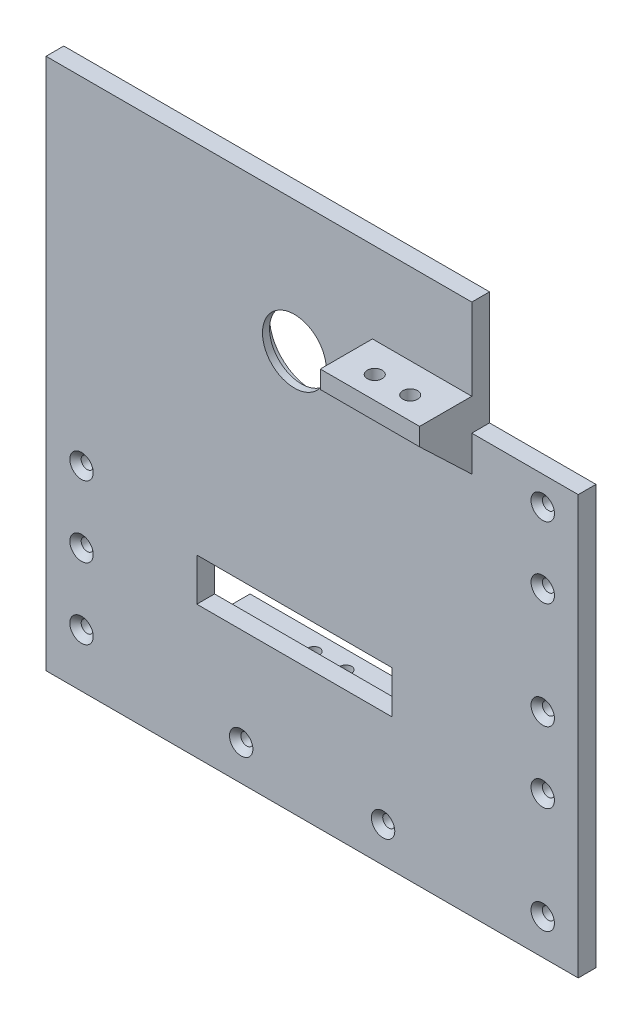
ISO-10303-21;
HEADER;
FILE_DESCRIPTION(('STEP AP214'),'2;1');
FILE_NAME('part.step','',(''),(''),'','','');
FILE_SCHEMA(('AUTOMOTIVE_DESIGN { 1 0 10303 214 1 1 1 1 }'));
ENDSEC;
DATA;
#1=APPLICATION_CONTEXT('core data for automotive mechanical design processes');
#2=APPLICATION_PROTOCOL_DEFINITION('international standard','automotive_design',2000,#1);
#3=PRODUCT_CONTEXT('',#1,'mechanical');
#4=PRODUCT('Part','Part','',(#3));
#5=PRODUCT_RELATED_PRODUCT_CATEGORY('part','',(#4));
#6=PRODUCT_DEFINITION_FORMATION('','',#4);
#7=PRODUCT_DEFINITION_CONTEXT('part definition',#1,'design');
#8=PRODUCT_DEFINITION('design','',#6,#7);
#9=PRODUCT_DEFINITION_SHAPE('','',#8);
#10=(LENGTH_UNIT() NAMED_UNIT(*) SI_UNIT(.MILLI.,.METRE.));
#11=(NAMED_UNIT(*) PLANE_ANGLE_UNIT() SI_UNIT($,.RADIAN.));
#12=(NAMED_UNIT(*) SI_UNIT($,.STERADIAN.) SOLID_ANGLE_UNIT());
#13=UNCERTAINTY_MEASURE_WITH_UNIT(LENGTH_MEASURE(1.E-05),#10,'distance_accuracy_value','');
#14=(GEOMETRIC_REPRESENTATION_CONTEXT(3) GLOBAL_UNCERTAINTY_ASSIGNED_CONTEXT((#13)) GLOBAL_UNIT_ASSIGNED_CONTEXT((#10,
#11,#12)) REPRESENTATION_CONTEXT('',''));
#15=CARTESIAN_POINT('',(0.,0.,0.));
#16=DIRECTION('',(0.,0.,1.));
#17=DIRECTION('',(1.,0.,0.));
#18=AXIS2_PLACEMENT_3D('',#15,#16,#17);
#19=CARTESIAN_POINT('',(0.,0.,0.));
#20=DIRECTION('',(0.,0.,1.));
#21=DIRECTION('',(1.,0.,0.));
#22=AXIS2_PLACEMENT_3D('',#19,#20,#21);
#23=PLANE('',#22);
#24=DIRECTION('',(-1.,0.,0.));
#25=VECTOR('',#24,1.);
#26=CARTESIAN_POINT('',(-27.5,-57.5,0.));
#27=LINE('',#26,#25);
#28=CARTESIAN_POINT('',(-27.5,-57.5,0.));
#29=VERTEX_POINT('',#28);
#30=CARTESIAN_POINT('',(-32.5,-57.5,0.));
#31=VERTEX_POINT('',#30);
#32=EDGE_CURVE('E369',#29,#31,#27,.T.);
#33=ORIENTED_EDGE('',*,*,#32,.F.);
#34=DIRECTION('',(0.,1.,0.));
#35=VECTOR('',#34,1.);
#36=CARTESIAN_POINT('',(-27.5,-57.5,0.));
#37=LINE('',#36,#35);
#38=CARTESIAN_POINT('',(-27.5,-47.5,0.));
#39=VERTEX_POINT('',#38);
#40=EDGE_CURVE('E363',#29,#39,#37,.T.);
#41=ORIENTED_EDGE('',*,*,#40,.T.);
#42=DIRECTION('',(-1.,0.,0.));
#43=VECTOR('',#42,1.);
#44=CARTESIAN_POINT('',(22.5,-47.5,0.));
#45=LINE('',#44,#43);
#46=CARTESIAN_POINT('',(17.5,-47.5,0.));
#47=VERTEX_POINT('',#46);
#48=EDGE_CURVE('E393',#47,#39,#45,.T.);
#49=ORIENTED_EDGE('',*,*,#48,.F.);
#50=DIRECTION('',(0.,-1.,0.));
#51=VECTOR('',#50,1.);
#52=CARTESIAN_POINT('',(17.5,-57.5,0.));
#53=LINE('',#52,#51);
#54=CARTESIAN_POINT('',(17.5,-57.5,0.));
#55=VERTEX_POINT('',#54);
#56=EDGE_CURVE('E378',#47,#55,#53,.T.);
#57=ORIENTED_EDGE('',*,*,#56,.T.);
#58=DIRECTION('',(1.,0.,0.));
#59=VECTOR('',#58,1.);
#60=CARTESIAN_POINT('',(17.5,-57.5,0.));
#61=LINE('',#60,#59);
#62=CARTESIAN_POINT('',(22.5,-57.5,0.));
#63=VERTEX_POINT('',#62);
#64=EDGE_CURVE('E383',#55,#63,#61,.T.);
#65=ORIENTED_EDGE('',*,*,#64,.T.);
#66=DIRECTION('',(0.,-1.,0.));
#67=VECTOR('',#66,1.);
#68=CARTESIAN_POINT('',(22.5,-42.5,0.));
#69=LINE('',#68,#67);
#70=CARTESIAN_POINT('',(22.5,-42.5,0.));
#71=VERTEX_POINT('',#70);
#72=EDGE_CURVE('E408',#71,#63,#69,.T.);
#73=ORIENTED_EDGE('',*,*,#72,.F.);
#74=DIRECTION('',(1.,0.,0.));
#75=VECTOR('',#74,1.);
#76=CARTESIAN_POINT('',(22.5,-42.5,0.));
#77=LINE('',#76,#75);
#78=CARTESIAN_POINT('',(-32.5,-42.5,0.));
#79=VERTEX_POINT('',#78);
#80=EDGE_CURVE('E405',#79,#71,#77,.T.);
#81=ORIENTED_EDGE('',*,*,#80,.F.);
#82=DIRECTION('',(0.,1.,0.));
#83=VECTOR('',#82,1.);
#84=CARTESIAN_POINT('',(-32.5,-42.5,0.));
#85=LINE('',#84,#83);
#86=EDGE_CURVE('E388',#31,#79,#85,.T.);
#87=ORIENTED_EDGE('',*,*,#86,.F.);
#88=EDGE_LOOP('',(#33,#41,#49,#57,#65,#73,#81,#87));
#89=FACE_BOUND('',#88,.T.);
#90=CARTESIAN_POINT('',(-5.00000000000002,38.,0.));
#91=DIRECTION('',(0.,0.,-1.));
#92=DIRECTION('',(-1.,0.,0.));
#93=AXIS2_PLACEMENT_3D('',#90,#91,#92);
#94=CIRCLE('',#93,12.05);
#95=CARTESIAN_POINT('',(-17.05,38.,0.));
#96=VERTEX_POINT('',#95);
#97=EDGE_CURVE('E417',#96,#96,#94,.T.);
#98=ORIENTED_EDGE('',*,*,#97,.F.);
#99=EDGE_LOOP('',(#98));
#100=FACE_BOUND('',#99,.T.);
#101=CARTESIAN_POINT('',(65.,35.,0.));
#102=DIRECTION('',(0.,0.,1.));
#103=DIRECTION('',(1.,0.,0.));
#104=AXIS2_PLACEMENT_3D('',#101,#102,#103);
#105=CIRCLE('',#104,1.69999999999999);
#106=CARTESIAN_POINT('',(66.7,35.,0.));
#107=VERTEX_POINT('',#106);
#108=EDGE_CURVE('E306',#107,#107,#105,.T.);
#109=ORIENTED_EDGE('',*,*,#108,.T.);
#110=EDGE_LOOP('',(#109));
#111=FACE_BOUND('',#110,.T.);
#112=CARTESIAN_POINT('',(65.,15.,0.));
#113=DIRECTION('',(0.,0.,1.));
#114=DIRECTION('',(1.,0.,0.));
#115=AXIS2_PLACEMENT_3D('',#112,#113,#114);
#116=CIRCLE('',#115,1.69999999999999);
#117=CARTESIAN_POINT('',(66.7,15.,0.));
#118=VERTEX_POINT('',#117);
#119=EDGE_CURVE('E301',#118,#118,#116,.T.);
#120=ORIENTED_EDGE('',*,*,#119,.T.);
#121=EDGE_LOOP('',(#120));
#122=FACE_BOUND('',#121,.T.);
#123=CARTESIAN_POINT('',(65.,-15.,0.));
#124=DIRECTION('',(0.,0.,1.));
#125=DIRECTION('',(1.,0.,0.));
#126=AXIS2_PLACEMENT_3D('',#123,#124,#125);
#127=CIRCLE('',#126,1.69999999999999);
#128=CARTESIAN_POINT('',(66.7,-15.,0.));
#129=VERTEX_POINT('',#128);
#130=EDGE_CURVE('E296',#129,#129,#127,.T.);
#131=ORIENTED_EDGE('',*,*,#130,.T.);
#132=EDGE_LOOP('',(#131));
#133=FACE_BOUND('',#132,.T.);
#134=CARTESIAN_POINT('',(65.,-35.,0.));
#135=DIRECTION('',(0.,0.,1.));
#136=DIRECTION('',(1.,0.,0.));
#137=AXIS2_PLACEMENT_3D('',#134,#135,#136);
#138=CIRCLE('',#137,1.69999999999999);
#139=CARTESIAN_POINT('',(66.7,-35.,0.));
#140=VERTEX_POINT('',#139);
#141=EDGE_CURVE('E291',#140,#140,#138,.T.);
#142=ORIENTED_EDGE('',*,*,#141,.T.);
#143=EDGE_LOOP('',(#142));
#144=FACE_BOUND('',#143,.T.);
#145=CARTESIAN_POINT('',(65.,-65.,0.));
#146=DIRECTION('',(0.,0.,1.));
#147=DIRECTION('',(1.,0.,0.));
#148=AXIS2_PLACEMENT_3D('',#145,#146,#147);
#149=CIRCLE('',#148,1.69999999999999);
#150=CARTESIAN_POINT('',(66.7,-65.,0.));
#151=VERTEX_POINT('',#150);
#152=EDGE_CURVE('E286',#151,#151,#149,.T.);
#153=ORIENTED_EDGE('',*,*,#152,.T.);
#154=EDGE_LOOP('',(#153));
#155=FACE_BOUND('',#154,.T.);
#156=CARTESIAN_POINT('',(20.,-65.,0.));
#157=DIRECTION('',(0.,0.,1.));
#158=DIRECTION('',(1.,0.,0.));
#159=AXIS2_PLACEMENT_3D('',#156,#157,#158);
#160=CIRCLE('',#159,1.69999999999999);
#161=CARTESIAN_POINT('',(21.7,-65.,0.));
#162=VERTEX_POINT('',#161);
#163=EDGE_CURVE('E281',#162,#162,#160,.T.);
#164=ORIENTED_EDGE('',*,*,#163,.T.);
#165=EDGE_LOOP('',(#164));
#166=FACE_BOUND('',#165,.T.);
#167=CARTESIAN_POINT('',(-20.,-65.,0.));
#168=DIRECTION('',(0.,0.,1.));
#169=DIRECTION('',(1.,0.,0.));
#170=AXIS2_PLACEMENT_3D('',#167,#168,#169);
#171=CIRCLE('',#170,1.69999999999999);
#172=CARTESIAN_POINT('',(-18.3,-65.,0.));
#173=VERTEX_POINT('',#172);
#174=EDGE_CURVE('E276',#173,#173,#171,.T.);
#175=ORIENTED_EDGE('',*,*,#174,.T.);
#176=EDGE_LOOP('',(#175));
#177=FACE_BOUND('',#176,.T.);
#178=CARTESIAN_POINT('',(-65.,-60.,0.));
#179=DIRECTION('',(0.,0.,1.));
#180=DIRECTION('',(1.,0.,0.));
#181=AXIS2_PLACEMENT_3D('',#178,#179,#180);
#182=CIRCLE('',#181,1.69999999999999);
#183=CARTESIAN_POINT('',(-63.3,-60.,0.));
#184=VERTEX_POINT('',#183);
#185=EDGE_CURVE('E271',#184,#184,#182,.T.);
#186=ORIENTED_EDGE('',*,*,#185,.T.);
#187=EDGE_LOOP('',(#186));
#188=FACE_BOUND('',#187,.T.);
#189=CARTESIAN_POINT('',(-65.,-40.,0.));
#190=DIRECTION('',(0.,0.,1.));
#191=DIRECTION('',(1.,0.,0.));
#192=AXIS2_PLACEMENT_3D('',#189,#190,#191);
#193=CIRCLE('',#192,1.69999999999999);
#194=CARTESIAN_POINT('',(-63.3,-40.,0.));
#195=VERTEX_POINT('',#194);
#196=EDGE_CURVE('E266',#195,#195,#193,.T.);
#197=ORIENTED_EDGE('',*,*,#196,.T.);
#198=EDGE_LOOP('',(#197));
#199=FACE_BOUND('',#198,.T.);
#200=CARTESIAN_POINT('',(-65.,-20.,0.));
#201=DIRECTION('',(0.,0.,1.));
#202=DIRECTION('',(1.,0.,0.));
#203=AXIS2_PLACEMENT_3D('',#200,#201,#202);
#204=CIRCLE('',#203,1.69999999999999);
#205=CARTESIAN_POINT('',(-63.3,-20.,0.));
#206=VERTEX_POINT('',#205);
#207=EDGE_CURVE('E262',#206,#206,#204,.T.);
#208=ORIENTED_EDGE('',*,*,#207,.T.);
#209=EDGE_LOOP('',(#208));
#210=FACE_BOUND('',#209,.T.);
#211=DIRECTION('',(-1.,0.,0.));
#212=VECTOR('',#211,1.);
#213=CARTESIAN_POINT('',(22.5,-37.5,0.));
#214=LINE('',#213,#212);
#215=CARTESIAN_POINT('',(22.5,-37.5,0.));
#216=VERTEX_POINT('',#215);
#217=CARTESIAN_POINT('',(-32.5,-37.5,0.));
#218=VERTEX_POINT('',#217);
#219=EDGE_CURVE('E534',#216,#218,#214,.T.);
#220=ORIENTED_EDGE('',*,*,#219,.F.);
#221=DIRECTION('',(0.,-1.,0.));
#222=VECTOR('',#221,1.);
#223=CARTESIAN_POINT('',(22.5,-25.5,0.));
#224=LINE('',#223,#222);
#225=CARTESIAN_POINT('',(22.5,-25.5,0.));
#226=VERTEX_POINT('',#225);
#227=EDGE_CURVE('E351',#226,#216,#224,.T.);
#228=ORIENTED_EDGE('',*,*,#227,.F.);
#229=DIRECTION('',(1.,0.,0.));
#230=VECTOR('',#229,1.);
#231=CARTESIAN_POINT('',(22.5,-25.5,0.));
#232=LINE('',#231,#230);
#233=CARTESIAN_POINT('',(-32.5,-25.5,0.));
#234=VERTEX_POINT('',#233);
#235=EDGE_CURVE('E352',#234,#226,#232,.T.);
#236=ORIENTED_EDGE('',*,*,#235,.F.);
#237=DIRECTION('',(0.,1.,0.));
#238=VECTOR('',#237,1.);
#239=CARTESIAN_POINT('',(-32.5,-25.5,0.));
#240=LINE('',#239,#238);
#241=EDGE_CURVE('E335',#218,#234,#240,.T.);
#242=ORIENTED_EDGE('',*,*,#241,.F.);
#243=EDGE_LOOP('',(#220,#228,#236,#242));
#244=FACE_BOUND('',#243,.T.);
#245=DIRECTION('',(0.,-1.,0.));
#246=VECTOR('',#245,1.);
#247=CARTESIAN_POINT('',(45.,75.,0.));
#248=LINE('',#247,#246);
#249=CARTESIAN_POINT('',(45.,75.,0.));
#250=VERTEX_POINT('',#249);
#251=CARTESIAN_POINT('',(45.,43.,0.));
#252=VERTEX_POINT('',#251);
#253=EDGE_CURVE('E200',#250,#252,#248,.T.);
#254=ORIENTED_EDGE('',*,*,#253,.T.);
#255=DIRECTION('',(1.,0.,0.));
#256=VECTOR('',#255,1.);
#257=CARTESIAN_POINT('',(45.,43.,0.));
#258=LINE('',#257,#256);
#259=CARTESIAN_POINT('',(75.,43.,0.));
#260=VERTEX_POINT('',#259);
#261=EDGE_CURVE('E204',#252,#260,#258,.T.);
#262=ORIENTED_EDGE('',*,*,#261,.T.);
#263=DIRECTION('',(0.,1.,0.));
#264=VECTOR('',#263,1.);
#265=CARTESIAN_POINT('',(75.,75.,0.));
#266=LINE('',#265,#264);
#267=CARTESIAN_POINT('',(75.,-75.,0.));
#268=VERTEX_POINT('',#267);
#269=EDGE_CURVE('E235',#268,#260,#266,.T.);
#270=ORIENTED_EDGE('',*,*,#269,.F.);
#271=DIRECTION('',(1.,0.,0.));
#272=VECTOR('',#271,1.);
#273=CARTESIAN_POINT('',(-75.,-75.,0.));
#274=LINE('',#273,#272);
#275=CARTESIAN_POINT('',(-75.,-75.,0.));
#276=VERTEX_POINT('',#275);
#277=EDGE_CURVE('E241',#276,#268,#274,.T.);
#278=ORIENTED_EDGE('',*,*,#277,.F.);
#279=DIRECTION('',(0.,-1.,0.));
#280=VECTOR('',#279,1.);
#281=CARTESIAN_POINT('',(-75.,75.,0.));
#282=LINE('',#281,#280);
#283=CARTESIAN_POINT('',(-75.,75.,0.));
#284=VERTEX_POINT('',#283);
#285=EDGE_CURVE('E250',#284,#276,#282,.T.);
#286=ORIENTED_EDGE('',*,*,#285,.F.);
#287=DIRECTION('',(-1.,0.,0.));
#288=VECTOR('',#287,1.);
#289=CARTESIAN_POINT('',(-75.,75.,0.));
#290=LINE('',#289,#288);
#291=EDGE_CURVE('E207',#250,#284,#290,.T.);
#292=ORIENTED_EDGE('',*,*,#291,.F.);
#293=EDGE_LOOP('',(#254,#262,#270,#278,#286,#292));
#294=FACE_BOUND('',#293,.T.);
#295=ADVANCED_FACE('F41',(#89,#100,#111,#122,#133,#144,#155,#166,#177,#188,#199,#210,#244,#294),
#23,.F.);
#296=CARTESIAN_POINT('',(22.5,-47.5,-10.));
#297=DIRECTION('',(0.,1.,0.));
#298=DIRECTION('',(0.,0.,1.));
#299=AXIS2_PLACEMENT_3D('',#296,#297,#298);
#300=PLANE('',#299);
#301=CARTESIAN_POINT('',(-9.5000000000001,-47.5,-5.));
#302=DIRECTION('',(0.,1.,0.));
#303=DIRECTION('',(0.,0.,1.));
#304=AXIS2_PLACEMENT_3D('',#301,#302,#303);
#305=CIRCLE('',#304,1.64999999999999);
#306=CARTESIAN_POINT('',(-9.5000000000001,-47.5,-3.35000000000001));
#307=VERTEX_POINT('',#306);
#308=EDGE_CURVE('E520',#307,#307,#305,.T.);
#309=ORIENTED_EDGE('',*,*,#308,.T.);
#310=EDGE_LOOP('',(#309));
#311=FACE_BOUND('',#310,.T.);
#312=CARTESIAN_POINT('',(-0.500000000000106,-47.5,-5.));
#313=DIRECTION('',(0.,1.,0.));
#314=DIRECTION('',(0.,0.,1.));
#315=AXIS2_PLACEMENT_3D('',#312,#313,#314);
#316=CIRCLE('',#315,1.64999999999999);
#317=CARTESIAN_POINT('',(-0.500000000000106,-47.5,-3.35000000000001));
#318=VERTEX_POINT('',#317);
#319=EDGE_CURVE('E530',#318,#318,#316,.T.);
#320=ORIENTED_EDGE('',*,*,#319,.T.);
#321=EDGE_LOOP('',(#320));
#322=FACE_BOUND('',#321,.T.);
#323=ORIENTED_EDGE('',*,*,#48,.T.);
#324=DIRECTION('',(0.,0.,-1.));
#325=VECTOR('',#324,1.);
#326=CARTESIAN_POINT('',(-27.5,-47.5,0.));
#327=LINE('',#326,#325);
#328=CARTESIAN_POINT('',(-27.5,-47.5,-10.));
#329=VERTEX_POINT('',#328);
#330=EDGE_CURVE('E357',#39,#329,#327,.T.);
#331=ORIENTED_EDGE('',*,*,#330,.T.);
#332=DIRECTION('',(-1.,0.,0.));
#333=VECTOR('',#332,1.);
#334=CARTESIAN_POINT('',(22.5,-47.5,-10.));
#335=LINE('',#334,#333);
#336=CARTESIAN_POINT('',(17.5,-47.5,-10.));
#337=VERTEX_POINT('',#336);
#338=EDGE_CURVE('E398',#337,#329,#335,.T.);
#339=ORIENTED_EDGE('',*,*,#338,.F.);
#340=DIRECTION('',(0.,0.,1.));
#341=VECTOR('',#340,1.);
#342=CARTESIAN_POINT('',(17.5,-47.5,0.));
#343=LINE('',#342,#341);
#344=EDGE_CURVE('E375',#337,#47,#343,.T.);
#345=ORIENTED_EDGE('',*,*,#344,.T.);
#346=EDGE_LOOP('',(#323,#331,#339,#345));
#347=FACE_BOUND('',#346,.T.);
#348=ADVANCED_FACE('F481',(#311,#322,#347),#300,.F.);
#349=CARTESIAN_POINT('',(-5.00000000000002,38.,0.));
#350=DIRECTION('',(0.,0.,1.));
#351=DIRECTION('',(1.,0.,0.));
#352=AXIS2_PLACEMENT_3D('',#349,#350,#351);
#353=CYLINDRICAL_SURFACE('',#352,9.);
#354=CARTESIAN_POINT('',(-5.00000000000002,38.,5.));
#355=DIRECTION('',(0.,0.,1.));
#356=DIRECTION('',(1.,0.,0.));
#357=AXIS2_PLACEMENT_3D('',#354,#355,#356);
#358=CIRCLE('',#357,9.);
#359=CARTESIAN_POINT('',(3.99999999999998,38.,5.));
#360=VERTEX_POINT('',#359);
#361=EDGE_CURVE('E231',#360,#360,#358,.T.);
#362=ORIENTED_EDGE('',*,*,#361,.T.);
#363=EDGE_LOOP('',(#362));
#364=FACE_BOUND('',#363,.T.);
#365=CARTESIAN_POINT('',(-5.00000000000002,38.,3.));
#366=DIRECTION('',(0.,0.,-1.));
#367=DIRECTION('',(-1.,0.,0.));
#368=AXIS2_PLACEMENT_3D('',#365,#366,#367);
#369=CIRCLE('',#368,9.);
#370=CARTESIAN_POINT('',(-14.,38.,3.));
#371=VERTEX_POINT('',#370);
#372=EDGE_CURVE('E311',#371,#371,#369,.F.);
#373=ORIENTED_EDGE('',*,*,#372,.F.);
#374=EDGE_LOOP('',(#373));
#375=FACE_BOUND('',#374,.T.);
#376=ADVANCED_FACE('F464',(#364,#375),#353,.F.);
#377=CARTESIAN_POINT('',(75.,75.,5.));
#378=DIRECTION('',(-1.,0.,0.));
#379=DIRECTION('',(0.,0.,1.));
#380=AXIS2_PLACEMENT_3D('',#377,#378,#379);
#381=PLANE('',#380);
#382=ORIENTED_EDGE('',*,*,#269,.T.);
#383=DIRECTION('',(0.,0.,1.));
#384=VECTOR('',#383,1.);
#385=CARTESIAN_POINT('',(75.,43.,0.));
#386=LINE('',#385,#384);
#387=CARTESIAN_POINT('',(75.,43.,5.));
#388=VERTEX_POINT('',#387);
#389=EDGE_CURVE('E220',#260,#388,#386,.T.);
#390=ORIENTED_EDGE('',*,*,#389,.T.);
#391=DIRECTION('',(0.,1.,0.));
#392=VECTOR('',#391,1.);
#393=CARTESIAN_POINT('',(75.,75.,5.));
#394=LINE('',#393,#392);
#395=CARTESIAN_POINT('',(75.,-75.,5.));
#396=VERTEX_POINT('',#395);
#397=EDGE_CURVE('E237',#396,#388,#394,.T.);
#398=ORIENTED_EDGE('',*,*,#397,.F.);
#399=DIRECTION('',(0.,0.,-1.));
#400=VECTOR('',#399,1.);
#401=CARTESIAN_POINT('',(75.,-75.,5.));
#402=LINE('',#401,#400);
#403=EDGE_CURVE('E247',#396,#268,#402,.T.);
#404=ORIENTED_EDGE('',*,*,#403,.T.);
#405=EDGE_LOOP('',(#382,#390,#398,#404));
#406=FACE_BOUND('',#405,.T.);
#407=ADVANCED_FACE('F43',(#406),#381,.F.);
#408=CARTESIAN_POINT('',(-75.,75.,5.));
#409=DIRECTION('',(0.,-1.,0.));
#410=DIRECTION('',(0.,0.,-1.));
#411=AXIS2_PLACEMENT_3D('',#408,#409,#410);
#412=PLANE('',#411);
#413=DIRECTION('',(-1.,0.,0.));
#414=VECTOR('',#413,1.);
#415=CARTESIAN_POINT('',(-75.,75.,5.));
#416=LINE('',#415,#414);
#417=CARTESIAN_POINT('',(45.,75.,5.));
#418=VERTEX_POINT('',#417);
#419=CARTESIAN_POINT('',(-75.,75.,5.));
#420=VERTEX_POINT('',#419);
#421=EDGE_CURVE('E240',#418,#420,#416,.T.);
#422=ORIENTED_EDGE('',*,*,#421,.F.);
#423=DIRECTION('',(0.,0.,1.));
#424=VECTOR('',#423,1.);
#425=CARTESIAN_POINT('',(45.,75.,0.));
#426=LINE('',#425,#424);
#427=EDGE_CURVE('E233',#250,#418,#426,.T.);
#428=ORIENTED_EDGE('',*,*,#427,.F.);
#429=ORIENTED_EDGE('',*,*,#291,.T.);
#430=DIRECTION('',(0.,0.,-1.));
#431=VECTOR('',#430,1.);
#432=CARTESIAN_POINT('',(-75.,75.,5.));
#433=LINE('',#432,#431);
#434=EDGE_CURVE('E258',#420,#284,#433,.T.);
#435=ORIENTED_EDGE('',*,*,#434,.F.);
#436=EDGE_LOOP('',(#422,#428,#429,#435));
#437=FACE_BOUND('',#436,.T.);
#438=ADVANCED_FACE('F492',(#437),#412,.F.);
#439=CARTESIAN_POINT('',(-75.,75.,5.));
#440=DIRECTION('',(1.,0.,0.));
#441=DIRECTION('',(0.,1.,0.));
#442=AXIS2_PLACEMENT_3D('',#439,#440,#441);
#443=PLANE('',#442);
#444=ORIENTED_EDGE('',*,*,#285,.T.);
#445=DIRECTION('',(0.,0.,-1.));
#446=VECTOR('',#445,1.);
#447=CARTESIAN_POINT('',(-75.,-75.,5.));
#448=LINE('',#447,#446);
#449=CARTESIAN_POINT('',(-75.,-75.,5.));
#450=VERTEX_POINT('',#449);
#451=EDGE_CURVE('E255',#450,#276,#448,.T.);
#452=ORIENTED_EDGE('',*,*,#451,.F.);
#453=DIRECTION('',(0.,-1.,0.));
#454=VECTOR('',#453,1.);
#455=CARTESIAN_POINT('',(-75.,75.,5.));
#456=LINE('',#455,#454);
#457=EDGE_CURVE('E243',#420,#450,#456,.T.);
#458=ORIENTED_EDGE('',*,*,#457,.F.);
#459=ORIENTED_EDGE('',*,*,#434,.T.);
#460=EDGE_LOOP('',(#444,#452,#458,#459));
#461=FACE_BOUND('',#460,.T.);
#462=ADVANCED_FACE('F475',(#461),#443,.F.);
#463=CARTESIAN_POINT('',(-75.,-75.,5.));
#464=DIRECTION('',(0.,1.,0.));
#465=DIRECTION('',(0.,0.,1.));
#466=AXIS2_PLACEMENT_3D('',#463,#464,#465);
#467=PLANE('',#466);
#468=ORIENTED_EDGE('',*,*,#277,.T.);
#469=ORIENTED_EDGE('',*,*,#403,.F.);
#470=DIRECTION('',(1.,0.,0.));
#471=VECTOR('',#470,1.);
#472=CARTESIAN_POINT('',(-75.,-75.,5.));
#473=LINE('',#472,#471);
#474=EDGE_CURVE('E245',#450,#396,#473,.T.);
#475=ORIENTED_EDGE('',*,*,#474,.F.);
#476=ORIENTED_EDGE('',*,*,#451,.T.);
#477=EDGE_LOOP('',(#468,#469,#475,#476));
#478=FACE_BOUND('',#477,.T.);
#479=ADVANCED_FACE('F468',(#478),#467,.F.);
#480=CARTESIAN_POINT('',(0.,0.,5.));
#481=DIRECTION('',(0.,0.,1.));
#482=DIRECTION('',(1.,0.,0.));
#483=AXIS2_PLACEMENT_3D('',#480,#481,#482);
#484=PLANE('',#483);
#485=DIRECTION('',(0.,1.,0.));
#486=VECTOR('',#485,1.);
#487=CARTESIAN_POINT('',(41.,33.,5.));
#488=LINE('',#487,#486);
#489=CARTESIAN_POINT('',(41.,33.,5.));
#490=VERTEX_POINT('',#489);
#491=CARTESIAN_POINT('',(41.,47.,5.));
#492=VERTEX_POINT('',#491);
#493=EDGE_CURVE('E1209',#490,#492,#488,.T.);
#494=ORIENTED_EDGE('',*,*,#493,.T.);
#495=DIRECTION('',(1.,0.,0.));
#496=VECTOR('',#495,1.);
#497=CARTESIAN_POINT('',(17.,47.,5.));
#498=LINE('',#497,#496);
#499=CARTESIAN_POINT('',(21.,47.,5.));
#500=VERTEX_POINT('',#499);
#501=EDGE_CURVE('E1241',#500,#492,#498,.T.);
#502=ORIENTED_EDGE('',*,*,#501,.F.);
#503=DIRECTION('',(0.,-1.,0.));
#504=VECTOR('',#503,1.);
#505=CARTESIAN_POINT('',(21.,33.,5.));
#506=LINE('',#505,#504);
#507=CARTESIAN_POINT('',(21.,33.,5.));
#508=VERTEX_POINT('',#507);
#509=EDGE_CURVE('E1223',#500,#508,#506,.T.);
#510=ORIENTED_EDGE('',*,*,#509,.T.);
#511=DIRECTION('',(-1.,0.,0.));
#512=VECTOR('',#511,1.);
#513=CARTESIAN_POINT('',(21.,33.,5.));
#514=LINE('',#513,#512);
#515=CARTESIAN_POINT('',(17.,33.,5.));
#516=VERTEX_POINT('',#515);
#517=EDGE_CURVE('E1226',#508,#516,#514,.T.);
#518=ORIENTED_EDGE('',*,*,#517,.T.);
#519=DIRECTION('',(0.,-1.,0.));
#520=VECTOR('',#519,1.);
#521=CARTESIAN_POINT('',(17.,52.,5.));
#522=LINE('',#521,#520);
#523=CARTESIAN_POINT('',(17.,52.,5.));
#524=VERTEX_POINT('',#523);
#525=EDGE_CURVE('E64',#524,#516,#522,.T.);
#526=ORIENTED_EDGE('',*,*,#525,.F.);
#527=DIRECTION('',(-1.,0.,0.));
#528=VECTOR('',#527,1.);
#529=CARTESIAN_POINT('',(17.,52.,5.));
#530=LINE('',#529,#528);
#531=CARTESIAN_POINT('',(45.,52.,5.));
#532=VERTEX_POINT('',#531);
#533=EDGE_CURVE('E505',#532,#524,#530,.T.);
#534=ORIENTED_EDGE('',*,*,#533,.F.);
#535=DIRECTION('',(0.,-1.,0.));
#536=VECTOR('',#535,1.);
#537=CARTESIAN_POINT('',(45.,75.,5.));
#538=LINE('',#537,#536);
#539=EDGE_CURVE('E228',#418,#532,#538,.T.);
#540=ORIENTED_EDGE('',*,*,#539,.F.);
#541=ORIENTED_EDGE('',*,*,#421,.T.);
#542=ORIENTED_EDGE('',*,*,#457,.T.);
#543=ORIENTED_EDGE('',*,*,#474,.T.);
#544=ORIENTED_EDGE('',*,*,#397,.T.);
#545=DIRECTION('',(1.,0.,0.));
#546=VECTOR('',#545,1.);
#547=CARTESIAN_POINT('',(45.,43.,5.));
#548=LINE('',#547,#546);
#549=CARTESIAN_POINT('',(45.,43.,5.));
#550=VERTEX_POINT('',#549);
#551=EDGE_CURVE('E210',#550,#388,#548,.T.);
#552=ORIENTED_EDGE('',*,*,#551,.F.);
#553=DIRECTION('',(0.,1.,0.));
#554=VECTOR('',#553,1.);
#555=CARTESIAN_POINT('',(45.,33.,5.));
#556=LINE('',#555,#554);
#557=CARTESIAN_POINT('',(45.,33.,5.));
#558=VERTEX_POINT('',#557);
#559=EDGE_CURVE('E217',#558,#550,#556,.T.);
#560=ORIENTED_EDGE('',*,*,#559,.F.);
#561=DIRECTION('',(1.,0.,0.));
#562=VECTOR('',#561,1.);
#563=CARTESIAN_POINT('',(41.,33.,5.));
#564=LINE('',#563,#562);
#565=EDGE_CURVE('E1214',#490,#558,#564,.T.);
#566=ORIENTED_EDGE('',*,*,#565,.F.);
#567=EDGE_LOOP('',(#494,#502,#510,#518,#526,#534,#540,#541,#542,#543,#544,#552,#560,#566));
#568=FACE_BOUND('',#567,.T.);
#569=DIRECTION('',(0.,1.,0.));
#570=VECTOR('',#569,1.);
#571=CARTESIAN_POINT('',(22.5,0.,5.));
#572=LINE('',#571,#570);
#573=CARTESIAN_POINT('',(22.5,-37.5,5.));
#574=VERTEX_POINT('',#573);
#575=CARTESIAN_POINT('',(22.5,-25.5,5.));
#576=VERTEX_POINT('',#575);
#577=EDGE_CURVE('E11',#574,#576,#572,.T.);
#578=ORIENTED_EDGE('',*,*,#577,.F.);
#579=DIRECTION('',(1.,0.,0.));
#580=VECTOR('',#579,1.);
#581=CARTESIAN_POINT('',(0.,-37.5,5.));
#582=LINE('',#581,#580);
#583=CARTESIAN_POINT('',(-32.5,-37.5,5.));
#584=VERTEX_POINT('',#583);
#585=EDGE_CURVE('E261',#584,#574,#582,.T.);
#586=ORIENTED_EDGE('',*,*,#585,.F.);
#587=DIRECTION('',(0.,-1.,0.));
#588=VECTOR('',#587,1.);
#589=CARTESIAN_POINT('',(-32.4999999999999,0.,5.));
#590=LINE('',#589,#588);
#591=CARTESIAN_POINT('',(-32.5,-25.5,5.));
#592=VERTEX_POINT('',#591);
#593=EDGE_CURVE('E317',#592,#584,#590,.T.);
#594=ORIENTED_EDGE('',*,*,#593,.F.);
#595=DIRECTION('',(-1.,0.,0.));
#596=VECTOR('',#595,1.);
#597=CARTESIAN_POINT('',(0.,-25.5,5.));
#598=LINE('',#597,#596);
#599=EDGE_CURVE('E49',#576,#592,#598,.T.);
#600=ORIENTED_EDGE('',*,*,#599,.F.);
#601=EDGE_LOOP('',(#578,#586,#594,#600));
#602=FACE_BOUND('',#601,.T.);
#603=CARTESIAN_POINT('',(65.,35.,5.));
#604=DIRECTION('',(0.,0.,1.));
#605=DIRECTION('',(1.,0.,0.));
#606=AXIS2_PLACEMENT_3D('',#603,#604,#605);
#607=CIRCLE('',#606,3.3);
#608=CARTESIAN_POINT('',(68.3,35.,5.));
#609=VERTEX_POINT('',#608);
#610=EDGE_CURVE('E314',#609,#609,#607,.T.);
#611=ORIENTED_EDGE('',*,*,#610,.F.);
#612=EDGE_LOOP('',(#611));
#613=FACE_BOUND('',#612,.T.);
#614=CARTESIAN_POINT('',(65.,15.,5.));
#615=DIRECTION('',(0.,0.,1.));
#616=DIRECTION('',(1.,0.,0.));
#617=AXIS2_PLACEMENT_3D('',#614,#615,#616);
#618=CIRCLE('',#617,3.3);
#619=CARTESIAN_POINT('',(68.3,15.,5.));
#620=VERTEX_POINT('',#619);
#621=EDGE_CURVE('E309',#620,#620,#618,.T.);
#622=ORIENTED_EDGE('',*,*,#621,.F.);
#623=EDGE_LOOP('',(#622));
#624=FACE_BOUND('',#623,.T.);
#625=CARTESIAN_POINT('',(65.,-15.,5.));
#626=DIRECTION('',(0.,0.,1.));
#627=DIRECTION('',(1.,0.,0.));
#628=AXIS2_PLACEMENT_3D('',#625,#626,#627);
#629=CIRCLE('',#628,3.3);
#630=CARTESIAN_POINT('',(68.3,-15.,5.));
#631=VERTEX_POINT('',#630);
#632=EDGE_CURVE('E304',#631,#631,#629,.T.);
#633=ORIENTED_EDGE('',*,*,#632,.F.);
#634=EDGE_LOOP('',(#633));
#635=FACE_BOUND('',#634,.T.);
#636=CARTESIAN_POINT('',(65.,-35.,5.));
#637=DIRECTION('',(0.,0.,1.));
#638=DIRECTION('',(1.,0.,0.));
#639=AXIS2_PLACEMENT_3D('',#636,#637,#638);
#640=CIRCLE('',#639,3.3);
#641=CARTESIAN_POINT('',(68.3,-35.,5.));
#642=VERTEX_POINT('',#641);
#643=EDGE_CURVE('E299',#642,#642,#640,.T.);
#644=ORIENTED_EDGE('',*,*,#643,.F.);
#645=EDGE_LOOP('',(#644));
#646=FACE_BOUND('',#645,.T.);
#647=CARTESIAN_POINT('',(65.,-65.,5.));
#648=DIRECTION('',(0.,0.,1.));
#649=DIRECTION('',(1.,0.,0.));
#650=AXIS2_PLACEMENT_3D('',#647,#648,#649);
#651=CIRCLE('',#650,3.3);
#652=CARTESIAN_POINT('',(68.3,-65.,5.));
#653=VERTEX_POINT('',#652);
#654=EDGE_CURVE('E294',#653,#653,#651,.T.);
#655=ORIENTED_EDGE('',*,*,#654,.F.);
#656=EDGE_LOOP('',(#655));
#657=FACE_BOUND('',#656,.T.);
#658=CARTESIAN_POINT('',(20.,-65.,5.));
#659=DIRECTION('',(0.,0.,1.));
#660=DIRECTION('',(1.,0.,0.));
#661=AXIS2_PLACEMENT_3D('',#658,#659,#660);
#662=CIRCLE('',#661,3.3);
#663=CARTESIAN_POINT('',(23.3,-65.,5.));
#664=VERTEX_POINT('',#663);
#665=EDGE_CURVE('E289',#664,#664,#662,.T.);
#666=ORIENTED_EDGE('',*,*,#665,.F.);
#667=EDGE_LOOP('',(#666));
#668=FACE_BOUND('',#667,.T.);
#669=CARTESIAN_POINT('',(-20.,-65.,5.));
#670=DIRECTION('',(0.,0.,1.));
#671=DIRECTION('',(1.,0.,0.));
#672=AXIS2_PLACEMENT_3D('',#669,#670,#671);
#673=CIRCLE('',#672,3.3);
#674=CARTESIAN_POINT('',(-16.7,-65.,5.));
#675=VERTEX_POINT('',#674);
#676=EDGE_CURVE('E284',#675,#675,#673,.T.);
#677=ORIENTED_EDGE('',*,*,#676,.F.);
#678=EDGE_LOOP('',(#677));
#679=FACE_BOUND('',#678,.T.);
#680=CARTESIAN_POINT('',(-65.,-60.,5.));
#681=DIRECTION('',(0.,0.,1.));
#682=DIRECTION('',(1.,0.,0.));
#683=AXIS2_PLACEMENT_3D('',#680,#681,#682);
#684=CIRCLE('',#683,3.3);
#685=CARTESIAN_POINT('',(-61.7,-60.,5.));
#686=VERTEX_POINT('',#685);
#687=EDGE_CURVE('E279',#686,#686,#684,.T.);
#688=ORIENTED_EDGE('',*,*,#687,.F.);
#689=EDGE_LOOP('',(#688));
#690=FACE_BOUND('',#689,.T.);
#691=CARTESIAN_POINT('',(-65.,-40.,5.));
#692=DIRECTION('',(0.,0.,1.));
#693=DIRECTION('',(1.,0.,0.));
#694=AXIS2_PLACEMENT_3D('',#691,#692,#693);
#695=CIRCLE('',#694,3.3);
#696=CARTESIAN_POINT('',(-61.7,-40.,5.));
#697=VERTEX_POINT('',#696);
#698=EDGE_CURVE('E274',#697,#697,#695,.T.);
#699=ORIENTED_EDGE('',*,*,#698,.F.);
#700=EDGE_LOOP('',(#699));
#701=FACE_BOUND('',#700,.T.);
#702=CARTESIAN_POINT('',(-65.,-20.,5.));
#703=DIRECTION('',(0.,0.,1.));
#704=DIRECTION('',(1.,0.,0.));
#705=AXIS2_PLACEMENT_3D('',#702,#703,#704);
#706=CIRCLE('',#705,3.3);
#707=CARTESIAN_POINT('',(-61.7,-20.,5.));
#708=VERTEX_POINT('',#707);
#709=EDGE_CURVE('E269',#708,#708,#706,.T.);
#710=ORIENTED_EDGE('',*,*,#709,.F.);
#711=EDGE_LOOP('',(#710));
#712=FACE_BOUND('',#711,.T.);
#713=ORIENTED_EDGE('',*,*,#361,.F.);
#714=EDGE_LOOP('',(#713));
#715=FACE_BOUND('',#714,.T.);
#716=ADVANCED_FACE('F339',(#568,#602,#613,#624,#635,#646,#657,#668,#679,#690,#701,#712,#715),
#484,.T.);
#717=CARTESIAN_POINT('',(45.,75.,0.));
#718=DIRECTION('',(-1.,0.,0.));
#719=DIRECTION('',(0.,0.,1.));
#720=AXIS2_PLACEMENT_3D('',#717,#718,#719);
#721=PLANE('',#720);
#722=DIRECTION('',(0.,0.,1.));
#723=VECTOR('',#722,1.);
#724=CARTESIAN_POINT('',(45.,43.,0.));
#725=LINE('',#724,#723);
#726=EDGE_CURVE('E213',#252,#550,#725,.T.);
#727=ORIENTED_EDGE('',*,*,#726,.F.);
#728=ORIENTED_EDGE('',*,*,#253,.F.);
#729=ORIENTED_EDGE('',*,*,#427,.T.);
#730=ORIENTED_EDGE('',*,*,#539,.T.);
#731=DIRECTION('',(0.,0.,-1.));
#732=VECTOR('',#731,1.);
#733=CARTESIAN_POINT('',(45.,52.,19.7));
#734=LINE('',#733,#732);
#735=CARTESIAN_POINT('',(45.,52.,19.7));
#736=VERTEX_POINT('',#735);
#737=EDGE_CURVE('E509',#736,#532,#734,.T.);
#738=ORIENTED_EDGE('',*,*,#737,.F.);
#739=DIRECTION('',(0.,1.,0.));
#740=VECTOR('',#739,1.);
#741=CARTESIAN_POINT('',(45.,52.,19.7));
#742=LINE('',#741,#740);
#743=CARTESIAN_POINT('',(45.,47.,19.7));
#744=VERTEX_POINT('',#743);
#745=EDGE_CURVE('E1237',#744,#736,#742,.T.);
#746=ORIENTED_EDGE('',*,*,#745,.F.);
#747=DIRECTION('',(0.,-0.689655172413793,-0.724137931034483));
#748=VECTOR('',#747,1.);
#749=CARTESIAN_POINT('',(45.,47.,19.7));
#750=LINE('',#749,#748);
#751=EDGE_CURVE('E1203',#744,#558,#750,.T.);
#752=ORIENTED_EDGE('',*,*,#751,.T.);
#753=ORIENTED_EDGE('',*,*,#559,.T.);
#754=EDGE_LOOP('',(#727,#728,#729,#730,#738,#746,#752,#753));
#755=FACE_BOUND('',#754,.T.);
#756=ADVANCED_FACE('F214',(#755),#721,.F.);
#757=CARTESIAN_POINT('',(45.,43.,0.));
#758=DIRECTION('',(0.,-1.,0.));
#759=DIRECTION('',(0.,0.,-1.));
#760=AXIS2_PLACEMENT_3D('',#757,#758,#759);
#761=PLANE('',#760);
#762=ORIENTED_EDGE('',*,*,#551,.T.);
#763=ORIENTED_EDGE('',*,*,#389,.F.);
#764=ORIENTED_EDGE('',*,*,#261,.F.);
#765=ORIENTED_EDGE('',*,*,#726,.T.);
#766=EDGE_LOOP('',(#762,#763,#764,#765));
#767=FACE_BOUND('',#766,.T.);
#768=ADVANCED_FACE('F222',(#767),#761,.F.);
#769=CARTESIAN_POINT('',(-65.,-20.,5.));
#770=DIRECTION('',(0.,0.,1.));
#771=DIRECTION('',(1.,0.,0.));
#772=AXIS2_PLACEMENT_3D('',#769,#770,#771);
#773=CYLINDRICAL_SURFACE('',#772,1.69999999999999);
#774=CARTESIAN_POINT('',(-65.,-20.,3.4));
#775=DIRECTION('',(0.,0.,1.));
#776=DIRECTION('',(1.,0.,0.));
#777=AXIS2_PLACEMENT_3D('',#774,#775,#776);
#778=CIRCLE('',#777,1.69999999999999);
#779=CARTESIAN_POINT('',(-63.3,-20.,3.4));
#780=VERTEX_POINT('',#779);
#781=EDGE_CURVE('E265',#780,#780,#778,.T.);
#782=ORIENTED_EDGE('',*,*,#781,.T.);
#783=EDGE_LOOP('',(#782));
#784=FACE_BOUND('',#783,.T.);
#785=ORIENTED_EDGE('',*,*,#207,.F.);
#786=EDGE_LOOP('',(#785));
#787=FACE_BOUND('',#786,.T.);
#788=ADVANCED_FACE('F678',(#784,#787),#773,.F.);
#789=CARTESIAN_POINT('',(-65.,-20.,5.));
#790=DIRECTION('',(0.,0.,1.));
#791=DIRECTION('',(1.,0.,0.));
#792=AXIS2_PLACEMENT_3D('',#789,#790,#791);
#793=CONICAL_SURFACE('',#792,3.3,0.785398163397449);
#794=ORIENTED_EDGE('',*,*,#781,.F.);
#795=EDGE_LOOP('',(#794));
#796=FACE_BOUND('',#795,.T.);
#797=ORIENTED_EDGE('',*,*,#709,.T.);
#798=EDGE_LOOP('',(#797));
#799=FACE_BOUND('',#798,.T.);
#800=ADVANCED_FACE('F674',(#796,#799),#793,.F.);
#801=CARTESIAN_POINT('',(-65.,-40.,5.));
#802=DIRECTION('',(0.,0.,1.));
#803=DIRECTION('',(1.,0.,0.));
#804=AXIS2_PLACEMENT_3D('',#801,#802,#803);
#805=CYLINDRICAL_SURFACE('',#804,1.69999999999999);
#806=CARTESIAN_POINT('',(-65.,-40.,3.4));
#807=DIRECTION('',(0.,0.,1.));
#808=DIRECTION('',(1.,0.,0.));
#809=AXIS2_PLACEMENT_3D('',#806,#807,#808);
#810=CIRCLE('',#809,1.69999999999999);
#811=CARTESIAN_POINT('',(-63.3,-40.,3.4));
#812=VERTEX_POINT('',#811);
#813=EDGE_CURVE('E270',#812,#812,#810,.T.);
#814=ORIENTED_EDGE('',*,*,#813,.T.);
#815=EDGE_LOOP('',(#814));
#816=FACE_BOUND('',#815,.T.);
#817=ORIENTED_EDGE('',*,*,#196,.F.);
#818=EDGE_LOOP('',(#817));
#819=FACE_BOUND('',#818,.T.);
#820=ADVANCED_FACE('F670',(#816,#819),#805,.F.);
#821=CARTESIAN_POINT('',(-65.,-40.,5.));
#822=DIRECTION('',(0.,0.,1.));
#823=DIRECTION('',(1.,0.,0.));
#824=AXIS2_PLACEMENT_3D('',#821,#822,#823);
#825=CONICAL_SURFACE('',#824,3.3,0.785398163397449);
#826=ORIENTED_EDGE('',*,*,#813,.F.);
#827=EDGE_LOOP('',(#826));
#828=FACE_BOUND('',#827,.T.);
#829=ORIENTED_EDGE('',*,*,#698,.T.);
#830=EDGE_LOOP('',(#829));
#831=FACE_BOUND('',#830,.T.);
#832=ADVANCED_FACE('F666',(#828,#831),#825,.F.);
#833=CARTESIAN_POINT('',(-65.,-60.,5.));
#834=DIRECTION('',(0.,0.,1.));
#835=DIRECTION('',(1.,0.,0.));
#836=AXIS2_PLACEMENT_3D('',#833,#834,#835);
#837=CYLINDRICAL_SURFACE('',#836,1.69999999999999);
#838=CARTESIAN_POINT('',(-65.,-60.,3.4));
#839=DIRECTION('',(0.,0.,1.));
#840=DIRECTION('',(1.,0.,0.));
#841=AXIS2_PLACEMENT_3D('',#838,#839,#840);
#842=CIRCLE('',#841,1.69999999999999);
#843=CARTESIAN_POINT('',(-63.3,-60.,3.4));
#844=VERTEX_POINT('',#843);
#845=EDGE_CURVE('E275',#844,#844,#842,.T.);
#846=ORIENTED_EDGE('',*,*,#845,.T.);
#847=EDGE_LOOP('',(#846));
#848=FACE_BOUND('',#847,.T.);
#849=ORIENTED_EDGE('',*,*,#185,.F.);
#850=EDGE_LOOP('',(#849));
#851=FACE_BOUND('',#850,.T.);
#852=ADVANCED_FACE('F662',(#848,#851),#837,.F.);
#853=CARTESIAN_POINT('',(-65.,-60.,5.));
#854=DIRECTION('',(0.,0.,1.));
#855=DIRECTION('',(1.,0.,0.));
#856=AXIS2_PLACEMENT_3D('',#853,#854,#855);
#857=CONICAL_SURFACE('',#856,3.3,0.785398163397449);
#858=ORIENTED_EDGE('',*,*,#845,.F.);
#859=EDGE_LOOP('',(#858));
#860=FACE_BOUND('',#859,.T.);
#861=ORIENTED_EDGE('',*,*,#687,.T.);
#862=EDGE_LOOP('',(#861));
#863=FACE_BOUND('',#862,.T.);
#864=ADVANCED_FACE('F658',(#860,#863),#857,.F.);
#865=CARTESIAN_POINT('',(-20.,-65.,5.));
#866=DIRECTION('',(0.,0.,1.));
#867=DIRECTION('',(1.,0.,0.));
#868=AXIS2_PLACEMENT_3D('',#865,#866,#867);
#869=CYLINDRICAL_SURFACE('',#868,1.69999999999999);
#870=CARTESIAN_POINT('',(-20.,-65.,3.4));
#871=DIRECTION('',(0.,0.,1.));
#872=DIRECTION('',(1.,0.,0.));
#873=AXIS2_PLACEMENT_3D('',#870,#871,#872);
#874=CIRCLE('',#873,1.7);
#875=CARTESIAN_POINT('',(-18.3,-65.,3.4));
#876=VERTEX_POINT('',#875);
#877=EDGE_CURVE('E280',#876,#876,#874,.T.);
#878=ORIENTED_EDGE('',*,*,#877,.T.);
#879=EDGE_LOOP('',(#878));
#880=FACE_BOUND('',#879,.T.);
#881=ORIENTED_EDGE('',*,*,#174,.F.);
#882=EDGE_LOOP('',(#881));
#883=FACE_BOUND('',#882,.T.);
#884=ADVANCED_FACE('F654',(#880,#883),#869,.F.);
#885=CARTESIAN_POINT('',(-20.,-65.,5.));
#886=DIRECTION('',(0.,0.,1.));
#887=DIRECTION('',(1.,0.,0.));
#888=AXIS2_PLACEMENT_3D('',#885,#886,#887);
#889=CONICAL_SURFACE('',#888,3.3,0.785398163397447);
#890=ORIENTED_EDGE('',*,*,#877,.F.);
#891=EDGE_LOOP('',(#890));
#892=FACE_BOUND('',#891,.T.);
#893=ORIENTED_EDGE('',*,*,#676,.T.);
#894=EDGE_LOOP('',(#893));
#895=FACE_BOUND('',#894,.T.);
#896=ADVANCED_FACE('F650',(#892,#895),#889,.F.);
#897=CARTESIAN_POINT('',(20.,-65.,5.));
#898=DIRECTION('',(0.,0.,1.));
#899=DIRECTION('',(1.,0.,0.));
#900=AXIS2_PLACEMENT_3D('',#897,#898,#899);
#901=CYLINDRICAL_SURFACE('',#900,1.69999999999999);
#902=CARTESIAN_POINT('',(20.,-65.,3.4));
#903=DIRECTION('',(0.,0.,1.));
#904=DIRECTION('',(1.,0.,0.));
#905=AXIS2_PLACEMENT_3D('',#902,#903,#904);
#906=CIRCLE('',#905,1.7);
#907=CARTESIAN_POINT('',(21.7,-65.,3.4));
#908=VERTEX_POINT('',#907);
#909=EDGE_CURVE('E285',#908,#908,#906,.T.);
#910=ORIENTED_EDGE('',*,*,#909,.T.);
#911=EDGE_LOOP('',(#910));
#912=FACE_BOUND('',#911,.T.);
#913=ORIENTED_EDGE('',*,*,#163,.F.);
#914=EDGE_LOOP('',(#913));
#915=FACE_BOUND('',#914,.T.);
#916=ADVANCED_FACE('F646',(#912,#915),#901,.F.);
#917=CARTESIAN_POINT('',(20.,-65.,5.));
#918=DIRECTION('',(0.,0.,1.));
#919=DIRECTION('',(1.,0.,0.));
#920=AXIS2_PLACEMENT_3D('',#917,#918,#919);
#921=CONICAL_SURFACE('',#920,3.3,0.785398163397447);
#922=ORIENTED_EDGE('',*,*,#909,.F.);
#923=EDGE_LOOP('',(#922));
#924=FACE_BOUND('',#923,.T.);
#925=ORIENTED_EDGE('',*,*,#665,.T.);
#926=EDGE_LOOP('',(#925));
#927=FACE_BOUND('',#926,.T.);
#928=ADVANCED_FACE('F642',(#924,#927),#921,.F.);
#929=CARTESIAN_POINT('',(65.,-65.,5.));
#930=DIRECTION('',(0.,0.,1.));
#931=DIRECTION('',(1.,0.,0.));
#932=AXIS2_PLACEMENT_3D('',#929,#930,#931);
#933=CYLINDRICAL_SURFACE('',#932,1.69999999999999);
#934=CARTESIAN_POINT('',(65.,-65.,3.4));
#935=DIRECTION('',(0.,0.,1.));
#936=DIRECTION('',(1.,0.,0.));
#937=AXIS2_PLACEMENT_3D('',#934,#935,#936);
#938=CIRCLE('',#937,1.69999999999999);
#939=CARTESIAN_POINT('',(66.7,-65.,3.4));
#940=VERTEX_POINT('',#939);
#941=EDGE_CURVE('E290',#940,#940,#938,.T.);
#942=ORIENTED_EDGE('',*,*,#941,.T.);
#943=EDGE_LOOP('',(#942));
#944=FACE_BOUND('',#943,.T.);
#945=ORIENTED_EDGE('',*,*,#152,.F.);
#946=EDGE_LOOP('',(#945));
#947=FACE_BOUND('',#946,.T.);
#948=ADVANCED_FACE('F638',(#944,#947),#933,.F.);
#949=CARTESIAN_POINT('',(65.,-65.,5.));
#950=DIRECTION('',(0.,0.,1.));
#951=DIRECTION('',(1.,0.,0.));
#952=AXIS2_PLACEMENT_3D('',#949,#950,#951);
#953=CONICAL_SURFACE('',#952,3.3,0.785398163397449);
#954=ORIENTED_EDGE('',*,*,#941,.F.);
#955=EDGE_LOOP('',(#954));
#956=FACE_BOUND('',#955,.T.);
#957=ORIENTED_EDGE('',*,*,#654,.T.);
#958=EDGE_LOOP('',(#957));
#959=FACE_BOUND('',#958,.T.);
#960=ADVANCED_FACE('F634',(#956,#959),#953,.F.);
#961=CARTESIAN_POINT('',(65.,-35.,5.));
#962=DIRECTION('',(0.,0.,1.));
#963=DIRECTION('',(1.,0.,0.));
#964=AXIS2_PLACEMENT_3D('',#961,#962,#963);
#965=CYLINDRICAL_SURFACE('',#964,1.69999999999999);
#966=CARTESIAN_POINT('',(65.,-35.,3.4));
#967=DIRECTION('',(0.,0.,1.));
#968=DIRECTION('',(1.,0.,0.));
#969=AXIS2_PLACEMENT_3D('',#966,#967,#968);
#970=CIRCLE('',#969,1.69999999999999);
#971=CARTESIAN_POINT('',(66.7,-35.,3.4));
#972=VERTEX_POINT('',#971);
#973=EDGE_CURVE('E295',#972,#972,#970,.T.);
#974=ORIENTED_EDGE('',*,*,#973,.T.);
#975=EDGE_LOOP('',(#974));
#976=FACE_BOUND('',#975,.T.);
#977=ORIENTED_EDGE('',*,*,#141,.F.);
#978=EDGE_LOOP('',(#977));
#979=FACE_BOUND('',#978,.T.);
#980=ADVANCED_FACE('F630',(#976,#979),#965,.F.);
#981=CARTESIAN_POINT('',(65.,-35.,5.));
#982=DIRECTION('',(0.,0.,1.));
#983=DIRECTION('',(1.,0.,0.));
#984=AXIS2_PLACEMENT_3D('',#981,#982,#983);
#985=CONICAL_SURFACE('',#984,3.3,0.785398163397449);
#986=ORIENTED_EDGE('',*,*,#973,.F.);
#987=EDGE_LOOP('',(#986));
#988=FACE_BOUND('',#987,.T.);
#989=ORIENTED_EDGE('',*,*,#643,.T.);
#990=EDGE_LOOP('',(#989));
#991=FACE_BOUND('',#990,.T.);
#992=ADVANCED_FACE('F626',(#988,#991),#985,.F.);
#993=CARTESIAN_POINT('',(65.,-15.,5.));
#994=DIRECTION('',(0.,0.,1.));
#995=DIRECTION('',(1.,0.,0.));
#996=AXIS2_PLACEMENT_3D('',#993,#994,#995);
#997=CYLINDRICAL_SURFACE('',#996,1.69999999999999);
#998=CARTESIAN_POINT('',(65.,-15.,3.4));
#999=DIRECTION('',(0.,0.,1.));
#1000=DIRECTION('',(1.,0.,0.));
#1001=AXIS2_PLACEMENT_3D('',#998,#999,#1000);
#1002=CIRCLE('',#1001,1.69999999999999);
#1003=CARTESIAN_POINT('',(66.7,-15.,3.4));
#1004=VERTEX_POINT('',#1003);
#1005=EDGE_CURVE('E300',#1004,#1004,#1002,.T.);
#1006=ORIENTED_EDGE('',*,*,#1005,.T.);
#1007=EDGE_LOOP('',(#1006));
#1008=FACE_BOUND('',#1007,.T.);
#1009=ORIENTED_EDGE('',*,*,#130,.F.);
#1010=EDGE_LOOP('',(#1009));
#1011=FACE_BOUND('',#1010,.T.);
#1012=ADVANCED_FACE('F622',(#1008,#1011),#997,.F.);
#1013=CARTESIAN_POINT('',(65.,-15.,5.));
#1014=DIRECTION('',(0.,0.,1.));
#1015=DIRECTION('',(1.,0.,0.));
#1016=AXIS2_PLACEMENT_3D('',#1013,#1014,#1015);
#1017=CONICAL_SURFACE('',#1016,3.3,0.785398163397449);
#1018=ORIENTED_EDGE('',*,*,#1005,.F.);
#1019=EDGE_LOOP('',(#1018));
#1020=FACE_BOUND('',#1019,.T.);
#1021=ORIENTED_EDGE('',*,*,#632,.T.);
#1022=EDGE_LOOP('',(#1021));
#1023=FACE_BOUND('',#1022,.T.);
#1024=ADVANCED_FACE('F618',(#1020,#1023),#1017,.F.);
#1025=CARTESIAN_POINT('',(65.,15.,5.));
#1026=DIRECTION('',(0.,0.,1.));
#1027=DIRECTION('',(1.,0.,0.));
#1028=AXIS2_PLACEMENT_3D('',#1025,#1026,#1027);
#1029=CYLINDRICAL_SURFACE('',#1028,1.69999999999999);
#1030=CARTESIAN_POINT('',(65.,15.,3.4));
#1031=DIRECTION('',(0.,0.,1.));
#1032=DIRECTION('',(1.,0.,0.));
#1033=AXIS2_PLACEMENT_3D('',#1030,#1031,#1032);
#1034=CIRCLE('',#1033,1.69999999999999);
#1035=CARTESIAN_POINT('',(66.7,15.,3.4));
#1036=VERTEX_POINT('',#1035);
#1037=EDGE_CURVE('E305',#1036,#1036,#1034,.T.);
#1038=ORIENTED_EDGE('',*,*,#1037,.T.);
#1039=EDGE_LOOP('',(#1038));
#1040=FACE_BOUND('',#1039,.T.);
#1041=ORIENTED_EDGE('',*,*,#119,.F.);
#1042=EDGE_LOOP('',(#1041));
#1043=FACE_BOUND('',#1042,.T.);
#1044=ADVANCED_FACE('F614',(#1040,#1043),#1029,.F.);
#1045=CARTESIAN_POINT('',(65.,15.,5.));
#1046=DIRECTION('',(0.,0.,1.));
#1047=DIRECTION('',(1.,0.,0.));
#1048=AXIS2_PLACEMENT_3D('',#1045,#1046,#1047);
#1049=CONICAL_SURFACE('',#1048,3.3,0.785398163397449);
#1050=ORIENTED_EDGE('',*,*,#1037,.F.);
#1051=EDGE_LOOP('',(#1050));
#1052=FACE_BOUND('',#1051,.T.);
#1053=ORIENTED_EDGE('',*,*,#621,.T.);
#1054=EDGE_LOOP('',(#1053));
#1055=FACE_BOUND('',#1054,.T.);
#1056=ADVANCED_FACE('F610',(#1052,#1055),#1049,.F.);
#1057=CARTESIAN_POINT('',(65.,35.,5.));
#1058=DIRECTION('',(0.,0.,1.));
#1059=DIRECTION('',(1.,0.,0.));
#1060=AXIS2_PLACEMENT_3D('',#1057,#1058,#1059);
#1061=CYLINDRICAL_SURFACE('',#1060,1.69999999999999);
#1062=CARTESIAN_POINT('',(65.,35.,3.4));
#1063=DIRECTION('',(0.,0.,1.));
#1064=DIRECTION('',(1.,0.,0.));
#1065=AXIS2_PLACEMENT_3D('',#1062,#1063,#1064);
#1066=CIRCLE('',#1065,1.69999999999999);
#1067=CARTESIAN_POINT('',(66.7,35.,3.4));
#1068=VERTEX_POINT('',#1067);
#1069=EDGE_CURVE('E310',#1068,#1068,#1066,.T.);
#1070=ORIENTED_EDGE('',*,*,#1069,.T.);
#1071=EDGE_LOOP('',(#1070));
#1072=FACE_BOUND('',#1071,.T.);
#1073=ORIENTED_EDGE('',*,*,#108,.F.);
#1074=EDGE_LOOP('',(#1073));
#1075=FACE_BOUND('',#1074,.T.);
#1076=ADVANCED_FACE('F606',(#1072,#1075),#1061,.F.);
#1077=CARTESIAN_POINT('',(65.,35.,5.));
#1078=DIRECTION('',(0.,0.,1.));
#1079=DIRECTION('',(1.,0.,0.));
#1080=AXIS2_PLACEMENT_3D('',#1077,#1078,#1079);
#1081=CONICAL_SURFACE('',#1080,3.3,0.785398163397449);
#1082=ORIENTED_EDGE('',*,*,#1069,.F.);
#1083=EDGE_LOOP('',(#1082));
#1084=FACE_BOUND('',#1083,.T.);
#1085=ORIENTED_EDGE('',*,*,#610,.T.);
#1086=EDGE_LOOP('',(#1085));
#1087=FACE_BOUND('',#1086,.T.);
#1088=ADVANCED_FACE('F599',(#1084,#1087),#1081,.F.);
#1089=CARTESIAN_POINT('',(-5.00000000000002,38.,3.));
#1090=DIRECTION('',(0.,0.,-1.));
#1091=DIRECTION('',(-1.,0.,0.));
#1092=AXIS2_PLACEMENT_3D('',#1089,#1090,#1091);
#1093=PLANE('',#1092);
#1094=CARTESIAN_POINT('',(-5.00000000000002,38.,3.));
#1095=DIRECTION('',(0.,0.,-1.));
#1096=DIRECTION('',(-1.,0.,0.));
#1097=AXIS2_PLACEMENT_3D('',#1094,#1095,#1096);
#1098=CIRCLE('',#1097,12.05);
#1099=CARTESIAN_POINT('',(-17.05,38.,3.));
#1100=VERTEX_POINT('',#1099);
#1101=EDGE_CURVE('E315',#1100,#1100,#1098,.T.);
#1102=ORIENTED_EDGE('',*,*,#1101,.T.);
#1103=EDGE_LOOP('',(#1102));
#1104=FACE_BOUND('',#1103,.T.);
#1105=ORIENTED_EDGE('',*,*,#372,.T.);
#1106=EDGE_LOOP('',(#1105));
#1107=FACE_BOUND('',#1106,.T.);
#1108=ADVANCED_FACE('F596',(#1104,#1107),#1093,.T.);
#1109=CARTESIAN_POINT('',(-5.00000000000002,38.,3.));
#1110=DIRECTION('',(0.,0.,-1.));
#1111=DIRECTION('',(-1.,0.,0.));
#1112=AXIS2_PLACEMENT_3D('',#1109,#1110,#1111);
#1113=CYLINDRICAL_SURFACE('',#1112,12.05);
#1114=ORIENTED_EDGE('',*,*,#1101,.F.);
#1115=EDGE_LOOP('',(#1114));
#1116=FACE_BOUND('',#1115,.T.);
#1117=ORIENTED_EDGE('',*,*,#97,.T.);
#1118=EDGE_LOOP('',(#1117));
#1119=FACE_BOUND('',#1118,.T.);
#1120=ADVANCED_FACE('F594',(#1116,#1119),#1113,.F.);
#1121=CARTESIAN_POINT('',(-32.5,-42.5,-10.));
#1122=DIRECTION('',(1.,0.,0.));
#1123=DIRECTION('',(0.,0.,-1.));
#1124=AXIS2_PLACEMENT_3D('',#1121,#1122,#1123);
#1125=PLANE('',#1124);
#1126=ORIENTED_EDGE('',*,*,#86,.T.);
#1127=DIRECTION('',(0.,0.,1.));
#1128=VECTOR('',#1127,1.);
#1129=CARTESIAN_POINT('',(-32.5,-42.5,-10.));
#1130=LINE('',#1129,#1128);
#1131=CARTESIAN_POINT('',(-32.5,-42.5,-10.));
#1132=VERTEX_POINT('',#1131);
#1133=EDGE_CURVE('E414',#1132,#79,#1130,.T.);
#1134=ORIENTED_EDGE('',*,*,#1133,.F.);
#1135=DIRECTION('',(0.,1.,0.));
#1136=VECTOR('',#1135,1.);
#1137=CARTESIAN_POINT('',(-32.5,-42.5,-10.));
#1138=LINE('',#1137,#1136);
#1139=CARTESIAN_POINT('',(-32.5,-47.5,-10.));
#1140=VERTEX_POINT('',#1139);
#1141=EDGE_CURVE('E389',#1140,#1132,#1138,.T.);
#1142=ORIENTED_EDGE('',*,*,#1141,.F.);
#1143=DIRECTION('',(0.,-0.707106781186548,0.707106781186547));
#1144=VECTOR('',#1143,1.);
#1145=CARTESIAN_POINT('',(-32.5,-47.5,-10.));
#1146=LINE('',#1145,#1144);
#1147=EDGE_CURVE('E361',#1140,#31,#1146,.T.);
#1148=ORIENTED_EDGE('',*,*,#1147,.T.);
#1149=EDGE_LOOP('',(#1126,#1134,#1142,#1148));
#1150=FACE_BOUND('',#1149,.T.);
#1151=ADVANCED_FACE('F590',(#1150),#1125,.F.);
#1152=CARTESIAN_POINT('',(22.5,-42.5,-10.));
#1153=DIRECTION('',(0.,-1.,0.));
#1154=DIRECTION('',(0.,0.,-1.));
#1155=AXIS2_PLACEMENT_3D('',#1152,#1153,#1154);
#1156=PLANE('',#1155);
#1157=CARTESIAN_POINT('',(-9.5000000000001,-42.5,-5.));
#1158=DIRECTION('',(0.,1.,0.));
#1159=DIRECTION('',(0.,0.,1.));
#1160=AXIS2_PLACEMENT_3D('',#1157,#1158,#1159);
#1161=CIRCLE('',#1160,1.64999999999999);
#1162=CARTESIAN_POINT('',(-9.5000000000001,-42.5,-3.35000000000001));
#1163=VERTEX_POINT('',#1162);
#1164=EDGE_CURVE('E516',#1163,#1163,#1161,.T.);
#1165=ORIENTED_EDGE('',*,*,#1164,.F.);
#1166=EDGE_LOOP('',(#1165));
#1167=FACE_BOUND('',#1166,.T.);
#1168=CARTESIAN_POINT('',(-0.500000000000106,-42.5,-5.));
#1169=DIRECTION('',(0.,1.,0.));
#1170=DIRECTION('',(0.,0.,1.));
#1171=AXIS2_PLACEMENT_3D('',#1168,#1169,#1170);
#1172=CIRCLE('',#1171,1.64999999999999);
#1173=CARTESIAN_POINT('',(-0.500000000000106,-42.5,-3.35000000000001));
#1174=VERTEX_POINT('',#1173);
#1175=EDGE_CURVE('E527',#1174,#1174,#1172,.T.);
#1176=ORIENTED_EDGE('',*,*,#1175,.F.);
#1177=EDGE_LOOP('',(#1176));
#1178=FACE_BOUND('',#1177,.T.);
#1179=ORIENTED_EDGE('',*,*,#80,.T.);
#1180=DIRECTION('',(0.,0.,1.));
#1181=VECTOR('',#1180,1.);
#1182=CARTESIAN_POINT('',(22.5,-42.5,-10.));
#1183=LINE('',#1182,#1181);
#1184=CARTESIAN_POINT('',(22.5,-42.5,-10.));
#1185=VERTEX_POINT('',#1184);
#1186=EDGE_CURVE('E402',#1185,#71,#1183,.T.);
#1187=ORIENTED_EDGE('',*,*,#1186,.F.);
#1188=DIRECTION('',(1.,0.,0.));
#1189=VECTOR('',#1188,1.);
#1190=CARTESIAN_POINT('',(22.5,-42.5,-10.));
#1191=LINE('',#1190,#1189);
#1192=EDGE_CURVE('E392',#1132,#1185,#1191,.T.);
#1193=ORIENTED_EDGE('',*,*,#1192,.F.);
#1194=ORIENTED_EDGE('',*,*,#1133,.T.);
#1195=EDGE_LOOP('',(#1179,#1187,#1193,#1194));
#1196=FACE_BOUND('',#1195,.T.);
#1197=ADVANCED_FACE('F586',(#1167,#1178,#1196),#1156,.F.);
#1198=CARTESIAN_POINT('',(22.5,-42.5,-10.));
#1199=DIRECTION('',(-1.,0.,0.));
#1200=DIRECTION('',(0.,0.,1.));
#1201=AXIS2_PLACEMENT_3D('',#1198,#1199,#1200);
#1202=PLANE('',#1201);
#1203=ORIENTED_EDGE('',*,*,#72,.T.);
#1204=DIRECTION('',(0.,0.707106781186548,-0.707106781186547));
#1205=VECTOR('',#1204,1.);
#1206=CARTESIAN_POINT('',(22.5,-47.5,-10.));
#1207=LINE('',#1206,#1205);
#1208=CARTESIAN_POINT('',(22.5,-47.5,-10.));
#1209=VERTEX_POINT('',#1208);
#1210=EDGE_CURVE('E372',#63,#1209,#1207,.T.);
#1211=ORIENTED_EDGE('',*,*,#1210,.T.);
#1212=DIRECTION('',(0.,-1.,0.));
#1213=VECTOR('',#1212,1.);
#1214=CARTESIAN_POINT('',(22.5,-42.5,-10.));
#1215=LINE('',#1214,#1213);
#1216=EDGE_CURVE('E395',#1185,#1209,#1215,.T.);
#1217=ORIENTED_EDGE('',*,*,#1216,.F.);
#1218=ORIENTED_EDGE('',*,*,#1186,.T.);
#1219=EDGE_LOOP('',(#1203,#1211,#1217,#1218));
#1220=FACE_BOUND('',#1219,.T.);
#1221=ADVANCED_FACE('F581',(#1220),#1202,.F.);
#1222=CARTESIAN_POINT('',(0.,0.,-10.));
#1223=DIRECTION('',(0.,0.,-1.));
#1224=DIRECTION('',(-1.,0.,0.));
#1225=AXIS2_PLACEMENT_3D('',#1222,#1223,#1224);
#1226=PLANE('',#1225);
#1227=ORIENTED_EDGE('',*,*,#1141,.T.);
#1228=ORIENTED_EDGE('',*,*,#1192,.T.);
#1229=ORIENTED_EDGE('',*,*,#1216,.T.);
#1230=EDGE_CURVE('E399',#1209,#337,#335,.T.);
#1231=ORIENTED_EDGE('',*,*,#1230,.T.);
#1232=ORIENTED_EDGE('',*,*,#338,.T.);
#1233=DIRECTION('',(-1.,0.,0.));
#1234=VECTOR('',#1233,1.);
#1235=CARTESIAN_POINT('',(-27.5,-47.5,-10.));
#1236=LINE('',#1235,#1234);
#1237=EDGE_CURVE('E366',#329,#1140,#1236,.T.);
#1238=ORIENTED_EDGE('',*,*,#1237,.T.);
#1239=EDGE_LOOP('',(#1227,#1228,#1229,#1231,#1232,#1238));
#1240=FACE_BOUND('',#1239,.T.);
#1241=ADVANCED_FACE('F578',(#1240),#1226,.T.);
#1242=CARTESIAN_POINT('',(17.5,-47.5,-10.));
#1243=DIRECTION('',(0.,-0.707106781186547,-0.707106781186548));
#1244=DIRECTION('',(0.,0.707106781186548,-0.707106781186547));
#1245=AXIS2_PLACEMENT_3D('',#1242,#1243,#1244);
#1246=PLANE('',#1245);
#1247=ORIENTED_EDGE('',*,*,#1210,.F.);
#1248=ORIENTED_EDGE('',*,*,#64,.F.);
#1249=DIRECTION('',(0.,0.707106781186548,-0.707106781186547));
#1250=VECTOR('',#1249,1.);
#1251=CARTESIAN_POINT('',(17.5,-47.5,-10.));
#1252=LINE('',#1251,#1250);
#1253=EDGE_CURVE('E381',#55,#337,#1252,.T.);
#1254=ORIENTED_EDGE('',*,*,#1253,.T.);
#1255=ORIENTED_EDGE('',*,*,#1230,.F.);
#1256=EDGE_LOOP('',(#1247,#1248,#1254,#1255));
#1257=FACE_BOUND('',#1256,.T.);
#1258=ADVANCED_FACE('F574',(#1257),#1246,.T.);
#1259=CARTESIAN_POINT('',(17.5,0.,0.));
#1260=DIRECTION('',(1.,0.,0.));
#1261=DIRECTION('',(0.,0.,-1.));
#1262=AXIS2_PLACEMENT_3D('',#1259,#1260,#1261);
#1263=PLANE('',#1262);
#1264=ORIENTED_EDGE('',*,*,#344,.F.);
#1265=ORIENTED_EDGE('',*,*,#1253,.F.);
#1266=ORIENTED_EDGE('',*,*,#56,.F.);
#1267=EDGE_LOOP('',(#1264,#1265,#1266));
#1268=FACE_BOUND('',#1267,.T.);
#1269=ADVANCED_FACE('F570',(#1268),#1263,.F.);
#1270=CARTESIAN_POINT('',(-27.5,-47.5,-10.));
#1271=DIRECTION('',(0.,-0.707106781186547,-0.707106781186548));
#1272=DIRECTION('',(0.,0.707106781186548,-0.707106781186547));
#1273=AXIS2_PLACEMENT_3D('',#1270,#1271,#1272);
#1274=PLANE('',#1273);
#1275=ORIENTED_EDGE('',*,*,#1147,.F.);
#1276=ORIENTED_EDGE('',*,*,#1237,.F.);
#1277=DIRECTION('',(0.,-0.707106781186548,0.707106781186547));
#1278=VECTOR('',#1277,1.);
#1279=CARTESIAN_POINT('',(-27.5,-47.5,-10.));
#1280=LINE('',#1279,#1278);
#1281=EDGE_CURVE('E360',#329,#29,#1280,.T.);
#1282=ORIENTED_EDGE('',*,*,#1281,.T.);
#1283=ORIENTED_EDGE('',*,*,#32,.T.);
#1284=EDGE_LOOP('',(#1275,#1276,#1282,#1283));
#1285=FACE_BOUND('',#1284,.T.);
#1286=ADVANCED_FACE('F566',(#1285),#1274,.T.);
#1287=CARTESIAN_POINT('',(-27.5,0.,0.));
#1288=DIRECTION('',(1.,0.,0.));
#1289=DIRECTION('',(0.,0.,-1.));
#1290=AXIS2_PLACEMENT_3D('',#1287,#1288,#1289);
#1291=PLANE('',#1290);
#1292=ORIENTED_EDGE('',*,*,#330,.F.);
#1293=ORIENTED_EDGE('',*,*,#40,.F.);
#1294=ORIENTED_EDGE('',*,*,#1281,.F.);
#1295=EDGE_LOOP('',(#1292,#1293,#1294));
#1296=FACE_BOUND('',#1295,.T.);
#1297=ADVANCED_FACE('F563',(#1296),#1291,.T.);
#1298=CARTESIAN_POINT('',(22.5,-25.5,10.));
#1299=DIRECTION('',(1.,0.,0.));
#1300=DIRECTION('',(0.,0.,-1.));
#1301=AXIS2_PLACEMENT_3D('',#1298,#1299,#1300);
#1302=PLANE('',#1301);
#1303=ORIENTED_EDGE('',*,*,#577,.T.);
#1304=DIRECTION('',(0.,0.,-1.));
#1305=VECTOR('',#1304,1.);
#1306=CARTESIAN_POINT('',(22.5,-25.5,10.));
#1307=LINE('',#1306,#1305);
#1308=EDGE_CURVE('E327',#576,#226,#1307,.T.);
#1309=ORIENTED_EDGE('',*,*,#1308,.T.);
#1310=ORIENTED_EDGE('',*,*,#227,.T.);
#1311=DIRECTION('',(0.,0.,-1.));
#1312=VECTOR('',#1311,1.);
#1313=CARTESIAN_POINT('',(22.5,-37.5,10.));
#1314=LINE('',#1313,#1312);
#1315=EDGE_CURVE('E346',#574,#216,#1314,.T.);
#1316=ORIENTED_EDGE('',*,*,#1315,.F.);
#1317=EDGE_LOOP('',(#1303,#1309,#1310,#1316));
#1318=FACE_BOUND('',#1317,.T.);
#1319=ADVANCED_FACE('F349',(#1318),#1302,.F.);
#1320=CARTESIAN_POINT('',(22.5,-25.5,10.));
#1321=DIRECTION('',(0.,1.,0.));
#1322=DIRECTION('',(-1.,0.,0.));
#1323=AXIS2_PLACEMENT_3D('',#1320,#1321,#1322);
#1324=PLANE('',#1323);
#1325=ORIENTED_EDGE('',*,*,#599,.T.);
#1326=DIRECTION('',(0.,0.,-1.));
#1327=VECTOR('',#1326,1.);
#1328=CARTESIAN_POINT('',(-32.5,-25.5,10.));
#1329=LINE('',#1328,#1327);
#1330=EDGE_CURVE('E325',#592,#234,#1329,.T.);
#1331=ORIENTED_EDGE('',*,*,#1330,.T.);
#1332=ORIENTED_EDGE('',*,*,#235,.T.);
#1333=ORIENTED_EDGE('',*,*,#1308,.F.);
#1334=EDGE_LOOP('',(#1325,#1331,#1332,#1333));
#1335=FACE_BOUND('',#1334,.T.);
#1336=ADVANCED_FACE('F323',(#1335),#1324,.F.);
#1337=CARTESIAN_POINT('',(-32.5,-25.5,10.));
#1338=DIRECTION('',(-1.,0.,0.));
#1339=DIRECTION('',(0.,-1.,0.));
#1340=AXIS2_PLACEMENT_3D('',#1337,#1338,#1339);
#1341=PLANE('',#1340);
#1342=ORIENTED_EDGE('',*,*,#593,.T.);
#1343=DIRECTION('',(0.,0.,-1.));
#1344=VECTOR('',#1343,1.);
#1345=CARTESIAN_POINT('',(-32.5,-37.5,10.));
#1346=LINE('',#1345,#1344);
#1347=EDGE_CURVE('E337',#584,#218,#1346,.T.);
#1348=ORIENTED_EDGE('',*,*,#1347,.T.);
#1349=ORIENTED_EDGE('',*,*,#241,.T.);
#1350=ORIENTED_EDGE('',*,*,#1330,.F.);
#1351=EDGE_LOOP('',(#1342,#1348,#1349,#1350));
#1352=FACE_BOUND('',#1351,.T.);
#1353=ADVANCED_FACE('F332',(#1352),#1341,.F.);
#1354=CARTESIAN_POINT('',(22.5,-37.5,10.));
#1355=DIRECTION('',(0.,-1.,0.));
#1356=DIRECTION('',(0.,0.,-1.));
#1357=AXIS2_PLACEMENT_3D('',#1354,#1355,#1356);
#1358=PLANE('',#1357);
#1359=ORIENTED_EDGE('',*,*,#585,.T.);
#1360=ORIENTED_EDGE('',*,*,#1315,.T.);
#1361=ORIENTED_EDGE('',*,*,#219,.T.);
#1362=ORIENTED_EDGE('',*,*,#1347,.F.);
#1363=EDGE_LOOP('',(#1359,#1360,#1361,#1362));
#1364=FACE_BOUND('',#1363,.T.);
#1365=ADVANCED_FACE('F344',(#1364),#1358,.F.);
#1366=CARTESIAN_POINT('',(-0.500000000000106,-42.5,-5.));
#1367=DIRECTION('',(0.,1.,0.));
#1368=DIRECTION('',(0.,0.,1.));
#1369=AXIS2_PLACEMENT_3D('',#1366,#1367,#1368);
#1370=CYLINDRICAL_SURFACE('',#1369,1.64999999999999);
#1371=ORIENTED_EDGE('',*,*,#1175,.T.);
#1372=EDGE_LOOP('',(#1371));
#1373=FACE_BOUND('',#1372,.T.);
#1374=ORIENTED_EDGE('',*,*,#319,.F.);
#1375=EDGE_LOOP('',(#1374));
#1376=FACE_BOUND('',#1375,.T.);
#1377=ADVANCED_FACE('F542',(#1373,#1376),#1370,.F.);
#1378=CARTESIAN_POINT('',(-9.5000000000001,-42.5,-5.));
#1379=DIRECTION('',(0.,1.,0.));
#1380=DIRECTION('',(0.,0.,1.));
#1381=AXIS2_PLACEMENT_3D('',#1378,#1379,#1380);
#1382=CYLINDRICAL_SURFACE('',#1381,1.64999999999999);
#1383=ORIENTED_EDGE('',*,*,#1164,.T.);
#1384=EDGE_LOOP('',(#1383));
#1385=FACE_BOUND('',#1384,.T.);
#1386=ORIENTED_EDGE('',*,*,#308,.F.);
#1387=EDGE_LOOP('',(#1386));
#1388=FACE_BOUND('',#1387,.T.);
#1389=ADVANCED_FACE('F544',(#1385,#1388),#1382,.F.);
#1390=CARTESIAN_POINT('',(17.,52.,19.7));
#1391=DIRECTION('',(1.,0.,0.));
#1392=DIRECTION('',(0.,0.,-1.));
#1393=AXIS2_PLACEMENT_3D('',#1390,#1391,#1392);
#1394=PLANE('',#1393);
#1395=ORIENTED_EDGE('',*,*,#525,.T.);
#1396=DIRECTION('',(0.,0.689655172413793,0.724137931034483));
#1397=VECTOR('',#1396,1.);
#1398=CARTESIAN_POINT('',(17.,47.,19.7));
#1399=LINE('',#1398,#1397);
#1400=CARTESIAN_POINT('',(17.,47.,19.7));
#1401=VERTEX_POINT('',#1400);
#1402=EDGE_CURVE('E1216',#516,#1401,#1399,.T.);
#1403=ORIENTED_EDGE('',*,*,#1402,.T.);
#1404=DIRECTION('',(0.,-1.,0.));
#1405=VECTOR('',#1404,1.);
#1406=CARTESIAN_POINT('',(17.,52.,19.7));
#1407=LINE('',#1406,#1405);
#1408=CARTESIAN_POINT('',(17.,52.,19.7));
#1409=VERTEX_POINT('',#1408);
#1410=EDGE_CURVE('E1230',#1409,#1401,#1407,.T.);
#1411=ORIENTED_EDGE('',*,*,#1410,.F.);
#1412=DIRECTION('',(0.,0.,-1.));
#1413=VECTOR('',#1412,1.);
#1414=CARTESIAN_POINT('',(17.,52.,19.7));
#1415=LINE('',#1414,#1413);
#1416=EDGE_CURVE('E517',#1409,#524,#1415,.T.);
#1417=ORIENTED_EDGE('',*,*,#1416,.T.);
#1418=EDGE_LOOP('',(#1395,#1403,#1411,#1417));
#1419=FACE_BOUND('',#1418,.T.);
#1420=ADVANCED_FACE('F551',(#1419),#1394,.F.);
#1421=CARTESIAN_POINT('',(17.,47.,19.7));
#1422=DIRECTION('',(0.,1.,0.));
#1423=DIRECTION('',(0.,0.,1.));
#1424=AXIS2_PLACEMENT_3D('',#1421,#1422,#1423);
#1425=PLANE('',#1424);
#1426=CARTESIAN_POINT('',(26.,47.,13.35));
#1427=DIRECTION('',(0.,1.,0.));
#1428=DIRECTION('',(0.,0.,1.));
#1429=AXIS2_PLACEMENT_3D('',#1426,#1427,#1428);
#1430=CIRCLE('',#1429,2.09999999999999);
#1431=CARTESIAN_POINT('',(26.,47.,15.45));
#1432=VERTEX_POINT('',#1431);
#1433=EDGE_CURVE('E1193',#1432,#1432,#1430,.T.);
#1434=ORIENTED_EDGE('',*,*,#1433,.T.);
#1435=EDGE_LOOP('',(#1434));
#1436=FACE_BOUND('',#1435,.T.);
#1437=CARTESIAN_POINT('',(36.,47.,13.35));
#1438=DIRECTION('',(0.,1.,0.));
#1439=DIRECTION('',(0.,0.,1.));
#1440=AXIS2_PLACEMENT_3D('',#1437,#1438,#1439);
#1441=CIRCLE('',#1440,2.09999999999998);
#1442=CARTESIAN_POINT('',(36.,47.,15.45));
#1443=VERTEX_POINT('',#1442);
#1444=EDGE_CURVE('E1197',#1443,#1443,#1441,.T.);
#1445=ORIENTED_EDGE('',*,*,#1444,.T.);
#1446=EDGE_LOOP('',(#1445));
#1447=FACE_BOUND('',#1446,.T.);
#1448=ORIENTED_EDGE('',*,*,#501,.T.);
#1449=DIRECTION('',(0.,0.,1.));
#1450=VECTOR('',#1449,1.);
#1451=CARTESIAN_POINT('',(41.,47.,5.));
#1452=LINE('',#1451,#1450);
#1453=CARTESIAN_POINT('',(41.,47.,19.7));
#1454=VERTEX_POINT('',#1453);
#1455=EDGE_CURVE('E1204',#492,#1454,#1452,.T.);
#1456=ORIENTED_EDGE('',*,*,#1455,.T.);
#1457=DIRECTION('',(1.,0.,0.));
#1458=VECTOR('',#1457,1.);
#1459=CARTESIAN_POINT('',(17.,47.,19.7));
#1460=LINE('',#1459,#1458);
#1461=CARTESIAN_POINT('',(21.,47.,19.7));
#1462=VERTEX_POINT('',#1461);
#1463=EDGE_CURVE('E1233',#1462,#1454,#1460,.T.);
#1464=ORIENTED_EDGE('',*,*,#1463,.F.);
#1465=DIRECTION('',(0.,0.,-1.));
#1466=VECTOR('',#1465,1.);
#1467=CARTESIAN_POINT('',(21.,47.,5.));
#1468=LINE('',#1467,#1466);
#1469=EDGE_CURVE('E1220',#1462,#500,#1468,.T.);
#1470=ORIENTED_EDGE('',*,*,#1469,.T.);
#1471=EDGE_LOOP('',(#1448,#1456,#1464,#1470));
#1472=FACE_BOUND('',#1471,.T.);
#1473=ADVANCED_FACE('F1057',(#1436,#1447,#1472),#1425,.F.);
#1474=CARTESIAN_POINT('',(17.,52.,19.7));
#1475=DIRECTION('',(0.,-1.,0.));
#1476=DIRECTION('',(0.,0.,-1.));
#1477=AXIS2_PLACEMENT_3D('',#1474,#1475,#1476);
#1478=PLANE('',#1477);
#1479=CARTESIAN_POINT('',(26.,52.,13.35));
#1480=DIRECTION('',(0.,1.,0.));
#1481=DIRECTION('',(0.,0.,1.));
#1482=AXIS2_PLACEMENT_3D('',#1479,#1480,#1481);
#1483=CIRCLE('',#1482,2.09999999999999);
#1484=CARTESIAN_POINT('',(26.,52.,15.45));
#1485=VERTEX_POINT('',#1484);
#1486=EDGE_CURVE('E1190',#1485,#1485,#1483,.T.);
#1487=ORIENTED_EDGE('',*,*,#1486,.F.);
#1488=EDGE_LOOP('',(#1487));
#1489=FACE_BOUND('',#1488,.T.);
#1490=CARTESIAN_POINT('',(36.,52.,13.35));
#1491=DIRECTION('',(0.,1.,0.));
#1492=DIRECTION('',(0.,0.,1.));
#1493=AXIS2_PLACEMENT_3D('',#1490,#1491,#1492);
#1494=CIRCLE('',#1493,2.09999999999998);
#1495=CARTESIAN_POINT('',(36.,52.,15.45));
#1496=VERTEX_POINT('',#1495);
#1497=EDGE_CURVE('E1194',#1496,#1496,#1494,.T.);
#1498=ORIENTED_EDGE('',*,*,#1497,.F.);
#1499=EDGE_LOOP('',(#1498));
#1500=FACE_BOUND('',#1499,.T.);
#1501=ORIENTED_EDGE('',*,*,#533,.T.);
#1502=ORIENTED_EDGE('',*,*,#1416,.F.);
#1503=DIRECTION('',(-1.,0.,0.));
#1504=VECTOR('',#1503,1.);
#1505=CARTESIAN_POINT('',(17.,52.,19.7));
#1506=LINE('',#1505,#1504);
#1507=EDGE_CURVE('E515',#736,#1409,#1506,.T.);
#1508=ORIENTED_EDGE('',*,*,#1507,.F.);
#1509=ORIENTED_EDGE('',*,*,#737,.T.);
#1510=EDGE_LOOP('',(#1501,#1502,#1508,#1509));
#1511=FACE_BOUND('',#1510,.T.);
#1512=ADVANCED_FACE('F512',(#1489,#1500,#1511),#1478,.F.);
#1513=CARTESIAN_POINT('',(0.,0.,19.7));
#1514=DIRECTION('',(0.,0.,1.));
#1515=DIRECTION('',(1.,0.,0.));
#1516=AXIS2_PLACEMENT_3D('',#1513,#1514,#1515);
#1517=PLANE('',#1516);
#1518=ORIENTED_EDGE('',*,*,#1410,.T.);
#1519=EDGE_CURVE('E1234',#1401,#1462,#1460,.T.);
#1520=ORIENTED_EDGE('',*,*,#1519,.T.);
#1521=ORIENTED_EDGE('',*,*,#1463,.T.);
#1522=DIRECTION('',(1.,0.,0.));
#1523=VECTOR('',#1522,1.);
#1524=CARTESIAN_POINT('',(41.,47.,19.7));
#1525=LINE('',#1524,#1523);
#1526=EDGE_CURVE('E1211',#1454,#744,#1525,.T.);
#1527=ORIENTED_EDGE('',*,*,#1526,.T.);
#1528=ORIENTED_EDGE('',*,*,#745,.T.);
#1529=ORIENTED_EDGE('',*,*,#1507,.T.);
#1530=EDGE_LOOP('',(#1518,#1520,#1521,#1527,#1528,#1529));
#1531=FACE_BOUND('',#1530,.T.);
#1532=ADVANCED_FACE('F1076',(#1531),#1517,.T.);
#1533=CARTESIAN_POINT('',(21.,47.,19.7));
#1534=DIRECTION('',(0.,-0.724137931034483,0.689655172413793));
#1535=DIRECTION('',(0.,-0.689655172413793,-0.724137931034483));
#1536=AXIS2_PLACEMENT_3D('',#1533,#1534,#1535);
#1537=PLANE('',#1536);
#1538=ORIENTED_EDGE('',*,*,#1402,.F.);
#1539=ORIENTED_EDGE('',*,*,#517,.F.);
#1540=DIRECTION('',(0.,0.689655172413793,0.724137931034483));
#1541=VECTOR('',#1540,1.);
#1542=CARTESIAN_POINT('',(21.,47.,19.7));
#1543=LINE('',#1542,#1541);
#1544=EDGE_CURVE('E56',#508,#1462,#1543,.T.);
#1545=ORIENTED_EDGE('',*,*,#1544,.T.);
#1546=ORIENTED_EDGE('',*,*,#1519,.F.);
#1547=EDGE_LOOP('',(#1538,#1539,#1545,#1546));
#1548=FACE_BOUND('',#1547,.T.);
#1549=ADVANCED_FACE('F1086',(#1548),#1537,.T.);
#1550=CARTESIAN_POINT('',(21.,0.,0.));
#1551=DIRECTION('',(1.,0.,0.));
#1552=DIRECTION('',(0.,0.,-1.));
#1553=AXIS2_PLACEMENT_3D('',#1550,#1551,#1552);
#1554=PLANE('',#1553);
#1555=ORIENTED_EDGE('',*,*,#1544,.F.);
#1556=ORIENTED_EDGE('',*,*,#509,.F.);
#1557=ORIENTED_EDGE('',*,*,#1469,.F.);
#1558=EDGE_LOOP('',(#1555,#1556,#1557));
#1559=FACE_BOUND('',#1558,.T.);
#1560=ADVANCED_FACE('F1095',(#1559),#1554,.T.);
#1561=CARTESIAN_POINT('',(41.,47.,19.7));
#1562=DIRECTION('',(0.,-0.724137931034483,0.689655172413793));
#1563=DIRECTION('',(0.,-0.689655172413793,-0.724137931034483));
#1564=AXIS2_PLACEMENT_3D('',#1561,#1562,#1563);
#1565=PLANE('',#1564);
#1566=ORIENTED_EDGE('',*,*,#751,.F.);
#1567=ORIENTED_EDGE('',*,*,#1526,.F.);
#1568=DIRECTION('',(0.,-0.689655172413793,-0.724137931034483));
#1569=VECTOR('',#1568,1.);
#1570=CARTESIAN_POINT('',(41.,47.,19.7));
#1571=LINE('',#1570,#1569);
#1572=EDGE_CURVE('E1207',#1454,#490,#1571,.T.);
#1573=ORIENTED_EDGE('',*,*,#1572,.T.);
#1574=ORIENTED_EDGE('',*,*,#565,.T.);
#1575=EDGE_LOOP('',(#1566,#1567,#1573,#1574));
#1576=FACE_BOUND('',#1575,.T.);
#1577=ADVANCED_FACE('F1104',(#1576),#1565,.T.);
#1578=CARTESIAN_POINT('',(41.,0.,0.));
#1579=DIRECTION('',(-1.,0.,0.));
#1580=DIRECTION('',(0.,0.,1.));
#1581=AXIS2_PLACEMENT_3D('',#1578,#1579,#1580);
#1582=PLANE('',#1581);
#1583=ORIENTED_EDGE('',*,*,#1455,.F.);
#1584=ORIENTED_EDGE('',*,*,#493,.F.);
#1585=ORIENTED_EDGE('',*,*,#1572,.F.);
#1586=EDGE_LOOP('',(#1583,#1584,#1585));
#1587=FACE_BOUND('',#1586,.T.);
#1588=ADVANCED_FACE('F1114',(#1587),#1582,.T.);
#1589=CARTESIAN_POINT('',(36.,52.,13.35));
#1590=DIRECTION('',(0.,1.,0.));
#1591=DIRECTION('',(0.,0.,1.));
#1592=AXIS2_PLACEMENT_3D('',#1589,#1590,#1591);
#1593=CYLINDRICAL_SURFACE('',#1592,2.09999999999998);
#1594=ORIENTED_EDGE('',*,*,#1497,.T.);
#1595=EDGE_LOOP('',(#1594));
#1596=FACE_BOUND('',#1595,.T.);
#1597=ORIENTED_EDGE('',*,*,#1444,.F.);
#1598=EDGE_LOOP('',(#1597));
#1599=FACE_BOUND('',#1598,.T.);
#1600=ADVANCED_FACE('F1124',(#1596,#1599),#1593,.F.);
#1601=CARTESIAN_POINT('',(26.,52.,13.35));
#1602=DIRECTION('',(0.,1.,0.));
#1603=DIRECTION('',(0.,0.,1.));
#1604=AXIS2_PLACEMENT_3D('',#1601,#1602,#1603);
#1605=CYLINDRICAL_SURFACE('',#1604,2.09999999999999);
#1606=ORIENTED_EDGE('',*,*,#1486,.T.);
#1607=EDGE_LOOP('',(#1606));
#1608=FACE_BOUND('',#1607,.T.);
#1609=ORIENTED_EDGE('',*,*,#1433,.F.);
#1610=EDGE_LOOP('',(#1609));
#1611=FACE_BOUND('',#1610,.T.);
#1612=ADVANCED_FACE('F1134',(#1608,#1611),#1605,.F.);
#1613=CLOSED_SHELL('',(#295,#348,#376,#407,#438,#462,#479,#716,#756,#768,#788,#800,#820,#832,
#852,#864,#884,#896,#916,#928,#948,#960,#980,#992,#1012,#1024,#1044,#1056,#1076,#1088,#1108,
#1120,#1151,#1197,#1221,#1241,#1258,#1269,#1286,#1297,#1319,#1336,#1353,#1365,#1377,#1389,#1420,
#1473,#1512,#1532,#1549,#1560,#1577,#1588,#1600,#1612));
#1614=MANIFOLD_SOLID_BREP('B2',#1613);
#1615=ADVANCED_BREP_SHAPE_REPRESENTATION('',(#18,#1614),#14);
#1616=SHAPE_DEFINITION_REPRESENTATION(#9,#1615);
ENDSEC;
END-ISO-10303-21;
